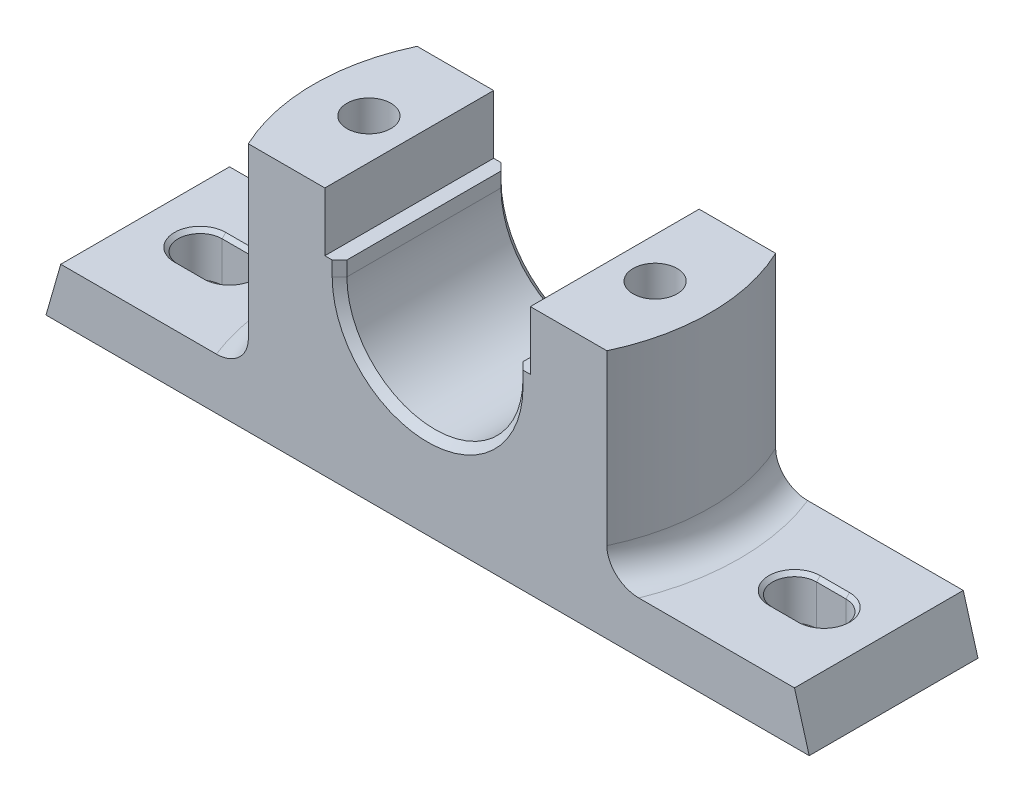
ISO-10303-21;
HEADER;
FILE_DESCRIPTION(('STEP AP214'),'2;1');
FILE_NAME('part.step','',(''),(''),'','','');
FILE_SCHEMA(('AUTOMOTIVE_DESIGN { 1 0 10303 214 1 1 1 1 }'));
ENDSEC;
DATA;
#1=APPLICATION_CONTEXT('core data for automotive mechanical design processes');
#2=APPLICATION_PROTOCOL_DEFINITION('international standard','automotive_design',2000,#1);
#3=PRODUCT_CONTEXT('',#1,'mechanical');
#4=PRODUCT('Part','Part','',(#3));
#5=PRODUCT_RELATED_PRODUCT_CATEGORY('part','',(#4));
#6=PRODUCT_DEFINITION_FORMATION('','',#4);
#7=PRODUCT_DEFINITION_CONTEXT('part definition',#1,'design');
#8=PRODUCT_DEFINITION('design','',#6,#7);
#9=PRODUCT_DEFINITION_SHAPE('','',#8);
#10=(LENGTH_UNIT() NAMED_UNIT(*) SI_UNIT(.MILLI.,.METRE.));
#11=(NAMED_UNIT(*) PLANE_ANGLE_UNIT() SI_UNIT($,.RADIAN.));
#12=(NAMED_UNIT(*) SI_UNIT($,.STERADIAN.) SOLID_ANGLE_UNIT());
#13=UNCERTAINTY_MEASURE_WITH_UNIT(LENGTH_MEASURE(1.E-05),#10,'distance_accuracy_value','');
#14=(GEOMETRIC_REPRESENTATION_CONTEXT(3) GLOBAL_UNCERTAINTY_ASSIGNED_CONTEXT((#13)) GLOBAL_UNIT_ASSIGNED_CONTEXT((#10,
#11,#12)) REPRESENTATION_CONTEXT('',''));
#15=CARTESIAN_POINT('',(0.,0.,0.));
#16=DIRECTION('',(0.,0.,1.));
#17=DIRECTION('',(1.,0.,0.));
#18=AXIS2_PLACEMENT_3D('',#15,#16,#17);
#19=CARTESIAN_POINT('',(54.,68.0000000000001,23.));
#20=DIRECTION('',(0.,-1.,0.));
#21=DIRECTION('',(1.,0.,0.));
#22=AXIS2_PLACEMENT_3D('',#19,#20,#21);
#23=PLANE('',#22);
#24=CARTESIAN_POINT('',(38.9999999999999,68.0000000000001,0.));
#25=DIRECTION('',(0.,1.,0.));
#26=DIRECTION('',(-1.,0.,0.));
#27=AXIS2_PLACEMENT_3D('',#24,#25,#26);
#28=CIRCLE('',#27,5.99999999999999);
#29=CARTESIAN_POINT('',(32.9999999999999,68.0000000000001,0.));
#30=VERTEX_POINT('',#29);
#31=EDGE_CURVE('E388',#30,#30,#28,.T.);
#32=ORIENTED_EDGE('',*,*,#31,.F.);
#33=EDGE_LOOP('',(#32));
#34=FACE_BOUND('',#33,.T.);
#35=CARTESIAN_POINT('',(0.,68.,0.));
#36=DIRECTION('',(0.,1.,0.));
#37=DIRECTION('',(-1.,0.,0.));
#38=AXIS2_PLACEMENT_3D('',#35,#36,#37);
#39=CIRCLE('',#38,53.9999999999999);
#40=CARTESIAN_POINT('',(48.8569340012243,68.0000000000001,23.));
#41=VERTEX_POINT('',#40);
#42=CARTESIAN_POINT('',(48.8569340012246,68.0000000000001,-23.));
#43=VERTEX_POINT('',#42);
#44=EDGE_CURVE('E498',#41,#43,#39,.T.);
#45=ORIENTED_EDGE('',*,*,#44,.T.);
#46=DIRECTION('',(-1.,0.,0.));
#47=VECTOR('',#46,1.);
#48=CARTESIAN_POINT('',(54.,68.0000000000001,-23.));
#49=LINE('',#48,#47);
#50=CARTESIAN_POINT('',(28.,68.0000000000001,-23.));
#51=VERTEX_POINT('',#50);
#52=EDGE_CURVE('E544',#43,#51,#49,.T.);
#53=ORIENTED_EDGE('',*,*,#52,.T.);
#54=DIRECTION('',(0.,0.,-1.));
#55=VECTOR('',#54,1.);
#56=CARTESIAN_POINT('',(28.,68.0000000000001,23.));
#57=LINE('',#56,#55);
#58=CARTESIAN_POINT('',(28.,68.0000000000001,23.));
#59=VERTEX_POINT('',#58);
#60=EDGE_CURVE('E582',#59,#51,#57,.T.);
#61=ORIENTED_EDGE('',*,*,#60,.F.);
#62=DIRECTION('',(-1.,0.,0.));
#63=VECTOR('',#62,1.);
#64=CARTESIAN_POINT('',(54.,68.0000000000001,23.));
#65=LINE('',#64,#63);
#66=EDGE_CURVE('E518',#41,#59,#65,.T.);
#67=ORIENTED_EDGE('',*,*,#66,.F.);
#68=EDGE_LOOP('',(#45,#53,#61,#67));
#69=FACE_BOUND('',#68,.T.);
#70=ADVANCED_FACE('F33',(#34,#69),#23,.F.);
#71=CARTESIAN_POINT('',(-54.,68.0000000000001,23.));
#72=DIRECTION('',(0.,-1.,0.));
#73=DIRECTION('',(1.,0.,0.));
#74=AXIS2_PLACEMENT_3D('',#71,#72,#73);
#75=PLANE('',#74);
#76=CARTESIAN_POINT('',(-38.9999999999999,68.0000000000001,0.));
#77=DIRECTION('',(0.,1.,0.));
#78=DIRECTION('',(-1.,0.,0.));
#79=AXIS2_PLACEMENT_3D('',#76,#77,#78);
#80=CIRCLE('',#79,5.99999999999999);
#81=CARTESIAN_POINT('',(-44.9999999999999,68.0000000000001,0.));
#82=VERTEX_POINT('',#81);
#83=EDGE_CURVE('E392',#82,#82,#80,.T.);
#84=ORIENTED_EDGE('',*,*,#83,.F.);
#85=EDGE_LOOP('',(#84));
#86=FACE_BOUND('',#85,.T.);
#87=CARTESIAN_POINT('',(0.,68.,0.));
#88=DIRECTION('',(0.,1.,0.));
#89=DIRECTION('',(-1.,0.,0.));
#90=AXIS2_PLACEMENT_3D('',#87,#88,#89);
#91=CIRCLE('',#90,53.9999999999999);
#92=CARTESIAN_POINT('',(-48.8569340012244,68.,-23.));
#93=VERTEX_POINT('',#92);
#94=CARTESIAN_POINT('',(-48.8569340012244,68.,23.));
#95=VERTEX_POINT('',#94);
#96=EDGE_CURVE('E493',#93,#95,#91,.T.);
#97=ORIENTED_EDGE('',*,*,#96,.T.);
#98=DIRECTION('',(-1.,0.,0.));
#99=VECTOR('',#98,1.);
#100=CARTESIAN_POINT('',(-54.,68.0000000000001,23.));
#101=LINE('',#100,#99);
#102=CARTESIAN_POINT('',(-28.,68.,23.));
#103=VERTEX_POINT('',#102);
#104=EDGE_CURVE('E529',#103,#95,#101,.T.);
#105=ORIENTED_EDGE('',*,*,#104,.F.);
#106=DIRECTION('',(0.,0.,-1.));
#107=VECTOR('',#106,1.);
#108=CARTESIAN_POINT('',(-28.,68.,23.));
#109=LINE('',#108,#107);
#110=CARTESIAN_POINT('',(-28.,68.,-23.));
#111=VERTEX_POINT('',#110);
#112=EDGE_CURVE('E561',#103,#111,#109,.T.);
#113=ORIENTED_EDGE('',*,*,#112,.T.);
#114=DIRECTION('',(-1.,0.,0.));
#115=VECTOR('',#114,1.);
#116=CARTESIAN_POINT('',(-54.,68.0000000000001,-23.));
#117=LINE('',#116,#115);
#118=EDGE_CURVE('E555',#111,#93,#117,.T.);
#119=ORIENTED_EDGE('',*,*,#118,.T.);
#120=EDGE_LOOP('',(#97,#105,#113,#119));
#121=FACE_BOUND('',#120,.T.);
#122=ADVANCED_FACE('F709',(#86,#121),#75,.F.);
#123=CARTESIAN_POINT('',(-104.,0.,23.));
#124=DIRECTION('',(0.961261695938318,-0.275637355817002,0.));
#125=DIRECTION('',(0.275637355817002,0.961261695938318,0.));
#126=AXIS2_PLACEMENT_3D('',#123,#124,#125);
#127=PLANE('',#126);
#128=DIRECTION('',(-0.275637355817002,-0.961261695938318,0.));
#129=VECTOR('',#128,1.);
#130=CARTESIAN_POINT('',(-104.,0.,-23.));
#131=LINE('',#130,#129);
#132=CARTESIAN_POINT('',(-99.9855645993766,14.,-23.));
#133=VERTEX_POINT('',#132);
#134=CARTESIAN_POINT('',(-104.,0.,-23.));
#135=VERTEX_POINT('',#134);
#136=EDGE_CURVE('E506',#133,#135,#131,.T.);
#137=ORIENTED_EDGE('',*,*,#136,.T.);
#138=DIRECTION('',(0.,0.,-1.));
#139=VECTOR('',#138,1.);
#140=CARTESIAN_POINT('',(-104.,0.,23.));
#141=LINE('',#140,#139);
#142=CARTESIAN_POINT('',(-104.,0.,23.));
#143=VERTEX_POINT('',#142);
#144=EDGE_CURVE('E591',#143,#135,#141,.T.);
#145=ORIENTED_EDGE('',*,*,#144,.F.);
#146=DIRECTION('',(-0.275637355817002,-0.961261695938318,0.));
#147=VECTOR('',#146,1.);
#148=CARTESIAN_POINT('',(-104.,0.,23.));
#149=LINE('',#148,#147);
#150=CARTESIAN_POINT('',(-99.9855645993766,14.,23.));
#151=VERTEX_POINT('',#150);
#152=EDGE_CURVE('E507',#151,#143,#149,.T.);
#153=ORIENTED_EDGE('',*,*,#152,.F.);
#154=DIRECTION('',(0.,0.,-1.));
#155=VECTOR('',#154,1.);
#156=CARTESIAN_POINT('',(-99.9855645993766,14.,23.));
#157=LINE('',#156,#155);
#158=EDGE_CURVE('E534',#151,#133,#157,.T.);
#159=ORIENTED_EDGE('',*,*,#158,.T.);
#160=EDGE_LOOP('',(#137,#145,#153,#159));
#161=FACE_BOUND('',#160,.T.);
#162=ADVANCED_FACE('F715',(#161),#127,.F.);
#163=CARTESIAN_POINT('',(-104.,0.,23.));
#164=DIRECTION('',(0.,1.,0.));
#165=DIRECTION('',(-1.,0.,0.));
#166=AXIS2_PLACEMENT_3D('',#163,#164,#165);
#167=PLANE('',#166);
#168=DIRECTION('',(-1.,0.,0.));
#169=VECTOR('',#168,1.);
#170=CARTESIAN_POINT('',(-97.5,0.,17.5));
#171=LINE('',#170,#169);
#172=CARTESIAN_POINT('',(97.5,0.,17.5));
#173=VERTEX_POINT('',#172);
#174=CARTESIAN_POINT('',(-97.5,0.,17.5));
#175=VERTEX_POINT('',#174);
#176=EDGE_CURVE('E476',#173,#175,#171,.T.);
#177=ORIENTED_EDGE('',*,*,#176,.F.);
#178=DIRECTION('',(0.,0.,1.));
#179=VECTOR('',#178,1.);
#180=CARTESIAN_POINT('',(97.5,0.,-17.5));
#181=LINE('',#180,#179);
#182=CARTESIAN_POINT('',(97.5,0.,-17.5));
#183=VERTEX_POINT('',#182);
#184=EDGE_CURVE('E454',#183,#173,#181,.T.);
#185=ORIENTED_EDGE('',*,*,#184,.F.);
#186=DIRECTION('',(1.,0.,0.));
#187=VECTOR('',#186,1.);
#188=CARTESIAN_POINT('',(-97.5,0.,-17.5));
#189=LINE('',#188,#187);
#190=CARTESIAN_POINT('',(-97.5,0.,-17.5));
#191=VERTEX_POINT('',#190);
#192=EDGE_CURVE('E465',#191,#183,#189,.T.);
#193=ORIENTED_EDGE('',*,*,#192,.F.);
#194=DIRECTION('',(0.,0.,-1.));
#195=VECTOR('',#194,1.);
#196=CARTESIAN_POINT('',(-97.5,0.,-17.5));
#197=LINE('',#196,#195);
#198=EDGE_CURVE('E479',#175,#191,#197,.T.);
#199=ORIENTED_EDGE('',*,*,#198,.F.);
#200=EDGE_LOOP('',(#177,#185,#193,#199));
#201=FACE_BOUND('',#200,.T.);
#202=DIRECTION('',(1.,0.,0.));
#203=VECTOR('',#202,1.);
#204=CARTESIAN_POINT('',(-104.,0.,-23.));
#205=LINE('',#204,#203);
#206=CARTESIAN_POINT('',(104.,0.,-23.));
#207=VERTEX_POINT('',#206);
#208=EDGE_CURVE('E537',#135,#207,#205,.T.);
#209=ORIENTED_EDGE('',*,*,#208,.T.);
#210=DIRECTION('',(0.,0.,-1.));
#211=VECTOR('',#210,1.);
#212=CARTESIAN_POINT('',(104.,0.,23.));
#213=LINE('',#212,#211);
#214=CARTESIAN_POINT('',(104.,0.,23.));
#215=VERTEX_POINT('',#214);
#216=EDGE_CURVE('E588',#215,#207,#213,.T.);
#217=ORIENTED_EDGE('',*,*,#216,.F.);
#218=DIRECTION('',(1.,0.,0.));
#219=VECTOR('',#218,1.);
#220=CARTESIAN_POINT('',(-104.,0.,23.));
#221=LINE('',#220,#219);
#222=EDGE_CURVE('E510',#143,#215,#221,.T.);
#223=ORIENTED_EDGE('',*,*,#222,.F.);
#224=ORIENTED_EDGE('',*,*,#144,.T.);
#225=EDGE_LOOP('',(#209,#217,#223,#224));
#226=FACE_BOUND('',#225,.T.);
#227=ADVANCED_FACE('F731',(#201,#226),#167,.F.);
#228=CARTESIAN_POINT('',(104.,0.,23.));
#229=DIRECTION('',(-0.961261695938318,-0.275637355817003,0.));
#230=DIRECTION('',(0.275637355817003,-0.961261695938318,0.));
#231=AXIS2_PLACEMENT_3D('',#228,#229,#230);
#232=PLANE('',#231);
#233=DIRECTION('',(-0.275637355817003,0.961261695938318,0.));
#234=VECTOR('',#233,1.);
#235=CARTESIAN_POINT('',(104.,0.,-23.));
#236=LINE('',#235,#234);
#237=CARTESIAN_POINT('',(99.9855645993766,14.,-23.));
#238=VERTEX_POINT('',#237);
#239=EDGE_CURVE('E539',#207,#238,#236,.T.);
#240=ORIENTED_EDGE('',*,*,#239,.T.);
#241=DIRECTION('',(0.,0.,-1.));
#242=VECTOR('',#241,1.);
#243=CARTESIAN_POINT('',(99.9855645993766,14.,23.));
#244=LINE('',#243,#242);
#245=CARTESIAN_POINT('',(99.9855645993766,14.,23.));
#246=VERTEX_POINT('',#245);
#247=EDGE_CURVE('E585',#246,#238,#244,.T.);
#248=ORIENTED_EDGE('',*,*,#247,.F.);
#249=DIRECTION('',(-0.275637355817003,0.961261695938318,0.));
#250=VECTOR('',#249,1.);
#251=CARTESIAN_POINT('',(104.,0.,23.));
#252=LINE('',#251,#250);
#253=EDGE_CURVE('E513',#215,#246,#252,.T.);
#254=ORIENTED_EDGE('',*,*,#253,.F.);
#255=ORIENTED_EDGE('',*,*,#216,.T.);
#256=EDGE_LOOP('',(#240,#248,#254,#255));
#257=FACE_BOUND('',#256,.T.);
#258=ADVANCED_FACE('F727',(#257),#232,.F.);
#259=CARTESIAN_POINT('',(99.9855645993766,14.,23.));
#260=DIRECTION('',(0.,-1.,0.));
#261=DIRECTION('',(1.,0.,0.));
#262=AXIS2_PLACEMENT_3D('',#259,#260,#261);
#263=PLANE('',#262);
#264=DIRECTION('',(1.,0.,0.));
#265=VECTOR('',#264,1.);
#266=CARTESIAN_POINT('',(99.9855645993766,14.,-7.));
#267=LINE('',#266,#265);
#268=CARTESIAN_POINT('',(77.,14.,-7.));
#269=VERTEX_POINT('',#268);
#270=CARTESIAN_POINT('',(85.,14.,-7.));
#271=VERTEX_POINT('',#270);
#272=EDGE_CURVE('E870',#269,#271,#267,.T.);
#273=ORIENTED_EDGE('',*,*,#272,.T.);
#274=CARTESIAN_POINT('',(85.,14.,0.));
#275=DIRECTION('',(0.,-1.,0.));
#276=DIRECTION('',(1.,0.,0.));
#277=AXIS2_PLACEMENT_3D('',#274,#275,#276);
#278=CIRCLE('',#277,7.);
#279=CARTESIAN_POINT('',(85.,14.,7.));
#280=VERTEX_POINT('',#279);
#281=EDGE_CURVE('E867',#271,#280,#278,.T.);
#282=ORIENTED_EDGE('',*,*,#281,.T.);
#283=DIRECTION('',(-1.,0.,0.));
#284=VECTOR('',#283,1.);
#285=CARTESIAN_POINT('',(99.9855645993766,14.,7.));
#286=LINE('',#285,#284);
#287=CARTESIAN_POINT('',(77.,14.,7.));
#288=VERTEX_POINT('',#287);
#289=EDGE_CURVE('E872',#280,#288,#286,.T.);
#290=ORIENTED_EDGE('',*,*,#289,.T.);
#291=CARTESIAN_POINT('',(77.,14.,0.));
#292=DIRECTION('',(0.,-1.,0.));
#293=DIRECTION('',(1.,0.,0.));
#294=AXIS2_PLACEMENT_3D('',#291,#292,#293);
#295=CIRCLE('',#294,7.);
#296=EDGE_CURVE('E874',#288,#269,#295,.T.);
#297=ORIENTED_EDGE('',*,*,#296,.T.);
#298=EDGE_LOOP('',(#273,#282,#290,#297));
#299=FACE_BOUND('',#298,.T.);
#300=DIRECTION('',(-1.,0.,0.));
#301=VECTOR('',#300,1.);
#302=CARTESIAN_POINT('',(99.9855645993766,14.,-23.));
#303=LINE('',#302,#301);
#304=CARTESIAN_POINT('',(57.576036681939,14.,-23.));
#305=VERTEX_POINT('',#304);
#306=EDGE_CURVE('E541',#238,#305,#303,.T.);
#307=ORIENTED_EDGE('',*,*,#306,.T.);
#308=CARTESIAN_POINT('',(0.,14.,0.));
#309=DIRECTION('',(0.,-1.,0.));
#310=DIRECTION('',(1.,0.,0.));
#311=AXIS2_PLACEMENT_3D('',#308,#309,#310);
#312=CIRCLE('',#311,61.9999999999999);
#313=CARTESIAN_POINT('',(57.576036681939,14.,23.));
#314=VERTEX_POINT('',#313);
#315=EDGE_CURVE('E606',#305,#314,#312,.T.);
#316=ORIENTED_EDGE('',*,*,#315,.T.);
#317=DIRECTION('',(-1.,0.,0.));
#318=VECTOR('',#317,1.);
#319=CARTESIAN_POINT('',(99.9855645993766,14.,23.));
#320=LINE('',#319,#318);
#321=EDGE_CURVE('E515',#246,#314,#320,.T.);
#322=ORIENTED_EDGE('',*,*,#321,.F.);
#323=ORIENTED_EDGE('',*,*,#247,.T.);
#324=EDGE_LOOP('',(#307,#316,#322,#323));
#325=FACE_BOUND('',#324,.T.);
#326=ADVANCED_FACE('F724',(#299,#325),#263,.F.);
#327=CARTESIAN_POINT('',(28.,68.0000000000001,23.));
#328=DIRECTION('',(1.,0.,0.));
#329=DIRECTION('',(0.,0.,-1.));
#330=AXIS2_PLACEMENT_3D('',#327,#328,#329);
#331=PLANE('',#330);
#332=DIRECTION('',(0.,-1.,0.));
#333=VECTOR('',#332,1.);
#334=CARTESIAN_POINT('',(28.,68.0000000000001,-23.));
#335=LINE('',#334,#333);
#336=CARTESIAN_POINT('',(28.,52.,-23.));
#337=VERTEX_POINT('',#336);
#338=EDGE_CURVE('E546',#51,#337,#335,.T.);
#339=ORIENTED_EDGE('',*,*,#338,.T.);
#340=DIRECTION('',(0.,0.,-1.));
#341=VECTOR('',#340,1.);
#342=CARTESIAN_POINT('',(28.,52.,23.));
#343=LINE('',#342,#341);
#344=CARTESIAN_POINT('',(28.,52.,23.));
#345=VERTEX_POINT('',#344);
#346=EDGE_CURVE('E579',#345,#337,#343,.T.);
#347=ORIENTED_EDGE('',*,*,#346,.F.);
#348=DIRECTION('',(0.,-1.,0.));
#349=VECTOR('',#348,1.);
#350=CARTESIAN_POINT('',(28.,68.0000000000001,23.));
#351=LINE('',#350,#349);
#352=EDGE_CURVE('E520',#59,#345,#351,.T.);
#353=ORIENTED_EDGE('',*,*,#352,.F.);
#354=ORIENTED_EDGE('',*,*,#60,.T.);
#355=EDGE_LOOP('',(#339,#347,#353,#354));
#356=FACE_BOUND('',#355,.T.);
#357=ADVANCED_FACE('F722',(#356),#331,.F.);
#358=CARTESIAN_POINT('',(28.,52.,23.));
#359=DIRECTION('',(0.,-1.,0.));
#360=DIRECTION('',(1.,0.,0.));
#361=AXIS2_PLACEMENT_3D('',#358,#359,#360);
#362=PLANE('',#361);
#363=DIRECTION('',(-1.,0.,0.));
#364=VECTOR('',#363,1.);
#365=CARTESIAN_POINT('',(28.,52.,-23.));
#366=LINE('',#365,#364);
#367=CARTESIAN_POINT('',(26.,52.0000000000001,-23.));
#368=VERTEX_POINT('',#367);
#369=EDGE_CURVE('E548',#337,#368,#366,.T.);
#370=ORIENTED_EDGE('',*,*,#369,.T.);
#371=DIRECTION('',(0.707106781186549,0.,-0.707106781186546));
#372=VECTOR('',#371,1.);
#373=CARTESIAN_POINT('',(24.,52.0000000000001,-21.));
#374=LINE('',#373,#372);
#375=CARTESIAN_POINT('',(24.,52.0000000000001,-21.));
#376=VERTEX_POINT('',#375);
#377=EDGE_CURVE('E782',#368,#376,#374,.F.);
#378=ORIENTED_EDGE('',*,*,#377,.T.);
#379=DIRECTION('',(0.,0.,-1.));
#380=VECTOR('',#379,1.);
#381=CARTESIAN_POINT('',(24.,52.0000000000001,23.));
#382=LINE('',#381,#380);
#383=CARTESIAN_POINT('',(24.,52.0000000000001,21.));
#384=VERTEX_POINT('',#383);
#385=EDGE_CURVE('E576',#384,#376,#382,.T.);
#386=ORIENTED_EDGE('',*,*,#385,.F.);
#387=DIRECTION('',(0.707106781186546,0.,0.707106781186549));
#388=VECTOR('',#387,1.);
#389=CARTESIAN_POINT('',(26.,52.0000000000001,23.));
#390=LINE('',#389,#388);
#391=CARTESIAN_POINT('',(26.,52.0000000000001,23.));
#392=VERTEX_POINT('',#391);
#393=EDGE_CURVE('E781',#384,#392,#390,.T.);
#394=ORIENTED_EDGE('',*,*,#393,.T.);
#395=DIRECTION('',(-1.,0.,0.));
#396=VECTOR('',#395,1.);
#397=CARTESIAN_POINT('',(28.,52.,23.));
#398=LINE('',#397,#396);
#399=EDGE_CURVE('E522',#345,#392,#398,.T.);
#400=ORIENTED_EDGE('',*,*,#399,.F.);
#401=ORIENTED_EDGE('',*,*,#346,.T.);
#402=EDGE_LOOP('',(#370,#378,#386,#394,#400,#401));
#403=FACE_BOUND('',#402,.T.);
#404=ADVANCED_FACE('F778',(#403),#362,.F.);
#405=CARTESIAN_POINT('',(24.,52.0000000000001,23.));
#406=DIRECTION('',(1.,0.,0.));
#407=DIRECTION('',(0.,1.,0.));
#408=AXIS2_PLACEMENT_3D('',#405,#406,#407);
#409=PLANE('',#408);
#410=ORIENTED_EDGE('',*,*,#385,.T.);
#411=DIRECTION('',(0.,-1.,0.));
#412=VECTOR('',#411,1.);
#413=CARTESIAN_POINT('',(24.,52.0000000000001,-21.));
#414=LINE('',#413,#412);
#415=CARTESIAN_POINT('',(24.,48.0000000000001,-21.));
#416=VERTEX_POINT('',#415);
#417=EDGE_CURVE('E836',#376,#416,#414,.T.);
#418=ORIENTED_EDGE('',*,*,#417,.T.);
#419=DIRECTION('',(0.,0.,-1.));
#420=VECTOR('',#419,1.);
#421=CARTESIAN_POINT('',(24.,48.0000000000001,23.));
#422=LINE('',#421,#420);
#423=CARTESIAN_POINT('',(24.,48.0000000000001,21.));
#424=VERTEX_POINT('',#423);
#425=EDGE_CURVE('E573',#424,#416,#422,.T.);
#426=ORIENTED_EDGE('',*,*,#425,.F.);
#427=DIRECTION('',(0.,1.,0.));
#428=VECTOR('',#427,1.);
#429=CARTESIAN_POINT('',(24.,52.0000000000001,21.));
#430=LINE('',#429,#428);
#431=EDGE_CURVE('E841',#424,#384,#430,.T.);
#432=ORIENTED_EDGE('',*,*,#431,.T.);
#433=EDGE_LOOP('',(#410,#418,#426,#432));
#434=FACE_BOUND('',#433,.T.);
#435=ADVANCED_FACE('F1043',(#434),#409,.F.);
#436=CARTESIAN_POINT('',(0.,48.0000000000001,23.));
#437=DIRECTION('',(0.,0.,-1.));
#438=DIRECTION('',(-1.,0.,0.));
#439=AXIS2_PLACEMENT_3D('',#436,#437,#438);
#440=CYLINDRICAL_SURFACE('',#439,24.);
#441=ORIENTED_EDGE('',*,*,#425,.T.);
#442=CARTESIAN_POINT('',(0.,48.0000000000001,-21.));
#443=DIRECTION('',(0.,0.,1.));
#444=DIRECTION('',(1.,0.,0.));
#445=AXIS2_PLACEMENT_3D('',#442,#443,#444);
#446=CIRCLE('',#445,24.);
#447=CARTESIAN_POINT('',(-24.,48.0000000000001,-21.));
#448=VERTEX_POINT('',#447);
#449=EDGE_CURVE('E800',#416,#448,#446,.F.);
#450=ORIENTED_EDGE('',*,*,#449,.T.);
#451=DIRECTION('',(0.,0.,-1.));
#452=VECTOR('',#451,1.);
#453=CARTESIAN_POINT('',(-24.,48.0000000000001,23.));
#454=LINE('',#453,#452);
#455=CARTESIAN_POINT('',(-24.,48.0000000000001,21.));
#456=VERTEX_POINT('',#455);
#457=EDGE_CURVE('E570',#456,#448,#454,.T.);
#458=ORIENTED_EDGE('',*,*,#457,.F.);
#459=CARTESIAN_POINT('',(0.,48.0000000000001,21.));
#460=DIRECTION('',(0.,0.,1.));
#461=DIRECTION('',(1.,0.,0.));
#462=AXIS2_PLACEMENT_3D('',#459,#460,#461);
#463=CIRCLE('',#462,24.);
#464=EDGE_CURVE('E798',#456,#424,#463,.T.);
#465=ORIENTED_EDGE('',*,*,#464,.T.);
#466=EDGE_LOOP('',(#441,#450,#458,#465));
#467=FACE_BOUND('',#466,.T.);
#468=ADVANCED_FACE('F1035',(#467),#440,.F.);
#469=CARTESIAN_POINT('',(-24.,52.0000000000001,23.));
#470=DIRECTION('',(-1.,0.,0.));
#471=DIRECTION('',(0.,0.,1.));
#472=AXIS2_PLACEMENT_3D('',#469,#470,#471);
#473=PLANE('',#472);
#474=ORIENTED_EDGE('',*,*,#457,.T.);
#475=DIRECTION('',(0.,1.,0.));
#476=VECTOR('',#475,1.);
#477=CARTESIAN_POINT('',(-24.,52.0000000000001,-21.));
#478=LINE('',#477,#476);
#479=CARTESIAN_POINT('',(-24.,52.0000000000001,-21.));
#480=VERTEX_POINT('',#479);
#481=EDGE_CURVE('E792',#448,#480,#478,.T.);
#482=ORIENTED_EDGE('',*,*,#481,.T.);
#483=DIRECTION('',(0.,0.,-1.));
#484=VECTOR('',#483,1.);
#485=CARTESIAN_POINT('',(-24.,52.0000000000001,23.));
#486=LINE('',#485,#484);
#487=CARTESIAN_POINT('',(-24.,52.0000000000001,21.));
#488=VERTEX_POINT('',#487);
#489=EDGE_CURVE('E567',#488,#480,#486,.T.);
#490=ORIENTED_EDGE('',*,*,#489,.F.);
#491=DIRECTION('',(0.,-1.,0.));
#492=VECTOR('',#491,1.);
#493=CARTESIAN_POINT('',(-24.,48.0000000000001,21.));
#494=LINE('',#493,#492);
#495=EDGE_CURVE('E785',#488,#456,#494,.T.);
#496=ORIENTED_EDGE('',*,*,#495,.T.);
#497=EDGE_LOOP('',(#474,#482,#490,#496));
#498=FACE_BOUND('',#497,.T.);
#499=ADVANCED_FACE('F1028',(#498),#473,.F.);
#500=CARTESIAN_POINT('',(-28.,52.,23.));
#501=DIRECTION('',(0.,-1.,0.));
#502=DIRECTION('',(1.,0.,0.));
#503=AXIS2_PLACEMENT_3D('',#500,#501,#502);
#504=PLANE('',#503);
#505=ORIENTED_EDGE('',*,*,#489,.T.);
#506=DIRECTION('',(0.707106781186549,0.,0.707106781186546));
#507=VECTOR('',#506,1.);
#508=CARTESIAN_POINT('',(-24.,52.0000000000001,-21.));
#509=LINE('',#508,#507);
#510=CARTESIAN_POINT('',(-26.,52.0000000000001,-23.));
#511=VERTEX_POINT('',#510);
#512=EDGE_CURVE('E796',#480,#511,#509,.F.);
#513=ORIENTED_EDGE('',*,*,#512,.T.);
#514=DIRECTION('',(-1.,0.,0.));
#515=VECTOR('',#514,1.);
#516=CARTESIAN_POINT('',(-28.,52.,-23.));
#517=LINE('',#516,#515);
#518=CARTESIAN_POINT('',(-28.,52.,-23.));
#519=VERTEX_POINT('',#518);
#520=EDGE_CURVE('E551',#511,#519,#517,.T.);
#521=ORIENTED_EDGE('',*,*,#520,.T.);
#522=DIRECTION('',(0.,0.,-1.));
#523=VECTOR('',#522,1.);
#524=CARTESIAN_POINT('',(-28.,52.,23.));
#525=LINE('',#524,#523);
#526=CARTESIAN_POINT('',(-28.,52.,23.));
#527=VERTEX_POINT('',#526);
#528=EDGE_CURVE('E564',#527,#519,#525,.T.);
#529=ORIENTED_EDGE('',*,*,#528,.F.);
#530=DIRECTION('',(-1.,0.,0.));
#531=VECTOR('',#530,1.);
#532=CARTESIAN_POINT('',(-28.,52.,23.));
#533=LINE('',#532,#531);
#534=CARTESIAN_POINT('',(-26.,52.0000000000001,23.));
#535=VERTEX_POINT('',#534);
#536=EDGE_CURVE('E525',#535,#527,#533,.T.);
#537=ORIENTED_EDGE('',*,*,#536,.F.);
#538=DIRECTION('',(0.707106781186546,0.,-0.707106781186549));
#539=VECTOR('',#538,1.);
#540=CARTESIAN_POINT('',(-26.,52.0000000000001,23.));
#541=LINE('',#540,#539);
#542=EDGE_CURVE('E794',#535,#488,#541,.T.);
#543=ORIENTED_EDGE('',*,*,#542,.T.);
#544=EDGE_LOOP('',(#505,#513,#521,#529,#537,#543));
#545=FACE_BOUND('',#544,.T.);
#546=ADVANCED_FACE('F816',(#545),#504,.F.);
#547=CARTESIAN_POINT('',(-28.,68.,23.));
#548=DIRECTION('',(-1.,0.,0.));
#549=DIRECTION('',(0.,0.,1.));
#550=AXIS2_PLACEMENT_3D('',#547,#548,#549);
#551=PLANE('',#550);
#552=DIRECTION('',(0.,1.,0.));
#553=VECTOR('',#552,1.);
#554=CARTESIAN_POINT('',(-28.,68.,-23.));
#555=LINE('',#554,#553);
#556=EDGE_CURVE('E553',#519,#111,#555,.T.);
#557=ORIENTED_EDGE('',*,*,#556,.T.);
#558=ORIENTED_EDGE('',*,*,#112,.F.);
#559=DIRECTION('',(0.,1.,0.));
#560=VECTOR('',#559,1.);
#561=CARTESIAN_POINT('',(-28.,68.,23.));
#562=LINE('',#561,#560);
#563=EDGE_CURVE('E527',#527,#103,#562,.T.);
#564=ORIENTED_EDGE('',*,*,#563,.F.);
#565=ORIENTED_EDGE('',*,*,#528,.T.);
#566=EDGE_LOOP('',(#557,#558,#564,#565));
#567=FACE_BOUND('',#566,.T.);
#568=ADVANCED_FACE('F823',(#567),#551,.F.);
#569=CARTESIAN_POINT('',(-99.9855645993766,14.,23.));
#570=DIRECTION('',(0.,-1.,0.));
#571=DIRECTION('',(1.,0.,0.));
#572=AXIS2_PLACEMENT_3D('',#569,#570,#571);
#573=PLANE('',#572);
#574=DIRECTION('',(1.,0.,0.));
#575=VECTOR('',#574,1.);
#576=CARTESIAN_POINT('',(-99.9855645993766,14.,-7.));
#577=LINE('',#576,#575);
#578=CARTESIAN_POINT('',(-85.,14.,-7.));
#579=VERTEX_POINT('',#578);
#580=CARTESIAN_POINT('',(-77.,14.,-7.));
#581=VERTEX_POINT('',#580);
#582=EDGE_CURVE('E888',#579,#581,#577,.T.);
#583=ORIENTED_EDGE('',*,*,#582,.T.);
#584=CARTESIAN_POINT('',(-77.,14.,0.));
#585=DIRECTION('',(0.,-1.,0.));
#586=DIRECTION('',(1.,0.,0.));
#587=AXIS2_PLACEMENT_3D('',#584,#585,#586);
#588=CIRCLE('',#587,7.);
#589=CARTESIAN_POINT('',(-77.,14.,7.));
#590=VERTEX_POINT('',#589);
#591=EDGE_CURVE('E885',#581,#590,#588,.T.);
#592=ORIENTED_EDGE('',*,*,#591,.T.);
#593=DIRECTION('',(-1.,0.,0.));
#594=VECTOR('',#593,1.);
#595=CARTESIAN_POINT('',(-99.9855645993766,14.,7.));
#596=LINE('',#595,#594);
#597=CARTESIAN_POINT('',(-85.,14.,7.));
#598=VERTEX_POINT('',#597);
#599=EDGE_CURVE('E890',#590,#598,#596,.T.);
#600=ORIENTED_EDGE('',*,*,#599,.T.);
#601=CARTESIAN_POINT('',(-85.,14.,0.));
#602=DIRECTION('',(0.,-1.,0.));
#603=DIRECTION('',(1.,0.,0.));
#604=AXIS2_PLACEMENT_3D('',#601,#602,#603);
#605=CIRCLE('',#604,7.);
#606=EDGE_CURVE('E891',#598,#579,#605,.T.);
#607=ORIENTED_EDGE('',*,*,#606,.T.);
#608=EDGE_LOOP('',(#583,#592,#600,#607));
#609=FACE_BOUND('',#608,.T.);
#610=DIRECTION('',(-1.,0.,0.));
#611=VECTOR('',#610,1.);
#612=CARTESIAN_POINT('',(-99.9855645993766,14.,23.));
#613=LINE('',#612,#611);
#614=CARTESIAN_POINT('',(-57.5760366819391,14.,23.));
#615=VERTEX_POINT('',#614);
#616=EDGE_CURVE('E532',#615,#151,#613,.T.);
#617=ORIENTED_EDGE('',*,*,#616,.F.);
#618=CARTESIAN_POINT('',(0.,14.,0.));
#619=DIRECTION('',(0.,-1.,0.));
#620=DIRECTION('',(1.,0.,0.));
#621=AXIS2_PLACEMENT_3D('',#618,#619,#620);
#622=CIRCLE('',#621,61.9999999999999);
#623=CARTESIAN_POINT('',(-57.5760366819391,14.,-23.));
#624=VERTEX_POINT('',#623);
#625=EDGE_CURVE('E601',#615,#624,#622,.T.);
#626=ORIENTED_EDGE('',*,*,#625,.T.);
#627=DIRECTION('',(-1.,0.,0.));
#628=VECTOR('',#627,1.);
#629=CARTESIAN_POINT('',(-99.9855645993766,14.,-23.));
#630=LINE('',#629,#628);
#631=EDGE_CURVE('E511',#624,#133,#630,.T.);
#632=ORIENTED_EDGE('',*,*,#631,.T.);
#633=ORIENTED_EDGE('',*,*,#158,.F.);
#634=EDGE_LOOP('',(#617,#626,#632,#633));
#635=FACE_BOUND('',#634,.T.);
#636=ADVANCED_FACE('F630',(#609,#635),#573,.F.);
#637=CARTESIAN_POINT('',(0.,48.0000000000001,23.));
#638=DIRECTION('',(0.,0.,1.));
#639=DIRECTION('',(1.,0.,0.));
#640=AXIS2_PLACEMENT_3D('',#637,#638,#639);
#641=PLANE('',#640);
#642=ORIENTED_EDGE('',*,*,#399,.T.);
#643=DIRECTION('',(0.,-1.,0.));
#644=VECTOR('',#643,1.);
#645=CARTESIAN_POINT('',(26.,48.0000000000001,23.));
#646=LINE('',#645,#644);
#647=CARTESIAN_POINT('',(26.,48.0000000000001,23.));
#648=VERTEX_POINT('',#647);
#649=EDGE_CURVE('E12',#392,#648,#646,.T.);
#650=ORIENTED_EDGE('',*,*,#649,.T.);
#651=CARTESIAN_POINT('',(0.,48.0000000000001,23.));
#652=DIRECTION('',(0.,0.,1.));
#653=DIRECTION('',(1.,0.,0.));
#654=AXIS2_PLACEMENT_3D('',#651,#652,#653);
#655=CIRCLE('',#654,26.);
#656=CARTESIAN_POINT('',(-26.,48.0000000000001,23.));
#657=VERTEX_POINT('',#656);
#658=EDGE_CURVE('E49',#648,#657,#655,.F.);
#659=ORIENTED_EDGE('',*,*,#658,.T.);
#660=DIRECTION('',(0.,1.,0.));
#661=VECTOR('',#660,1.);
#662=CARTESIAN_POINT('',(-26.,52.0000000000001,23.));
#663=LINE('',#662,#661);
#664=EDGE_CURVE('E42',#657,#535,#663,.T.);
#665=ORIENTED_EDGE('',*,*,#664,.T.);
#666=ORIENTED_EDGE('',*,*,#536,.T.);
#667=ORIENTED_EDGE('',*,*,#563,.T.);
#668=ORIENTED_EDGE('',*,*,#104,.T.);
#669=DIRECTION('',(0.,1.,0.));
#670=VECTOR('',#669,1.);
#671=CARTESIAN_POINT('',(-48.8569340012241,-215.666901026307,23.));
#672=LINE('',#671,#670);
#673=CARTESIAN_POINT('',(-48.8569340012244,22.,23.));
#674=VERTEX_POINT('',#673);
#675=EDGE_CURVE('E501',#674,#95,#672,.T.);
#676=ORIENTED_EDGE('',*,*,#675,.F.);
#677=CARTESIAN_POINT('',(-48.8569340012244,22.,23.));
#678=CARTESIAN_POINT('',(-48.8568944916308,21.7897037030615,23.));
#679=CARTESIAN_POINT('',(-48.8660972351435,21.5794200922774,23.));
#680=CARTESIAN_POINT('',(-48.9026955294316,21.1604976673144,23.));
#681=CARTESIAN_POINT('',(-48.9300861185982,20.9518584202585,23.));
#682=CARTESIAN_POINT('',(-49.0026422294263,20.5384483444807,23.));
#683=CARTESIAN_POINT('',(-49.0477455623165,20.333666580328,23.));
#684=CARTESIAN_POINT('',(-49.1551914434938,19.928676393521,23.));
#685=CARTESIAN_POINT('',(-49.2175345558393,19.7284681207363,23.));
#686=CARTESIAN_POINT('',(-49.3587056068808,19.3341515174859,23.));
#687=CARTESIAN_POINT('',(-49.4375194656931,19.1400381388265,23.));
#688=CARTESIAN_POINT('',(-49.6108643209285,18.7588835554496,23.));
#689=CARTESIAN_POINT('',(-49.7054011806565,18.5718450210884,23.));
#690=CARTESIAN_POINT('',(-49.9092601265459,18.2059678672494,23.));
#691=CARTESIAN_POINT('',(-50.0185851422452,18.0271308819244,23.));
#692=CARTESIAN_POINT('',(-50.251044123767,17.6785870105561,23.));
#693=CARTESIAN_POINT('',(-50.374183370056,17.5088836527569,23.));
#694=CARTESIAN_POINT('',(-50.6386238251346,17.1726098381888,23.));
#695=CARTESIAN_POINT('',(-50.7804689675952,17.0064666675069,23.));
#696=CARTESIAN_POINT('',(-51.0768009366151,16.6858302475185,23.));
#697=CARTESIAN_POINT('',(-51.2312923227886,16.5313412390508,23.));
#698=CARTESIAN_POINT('',(-51.711907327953,16.0864805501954,23.));
#699=CARTESIAN_POINT('',(-52.0553511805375,15.8144890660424,23.));
#700=CARTESIAN_POINT('',(-52.8107494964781,15.3025371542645,23.));
#701=CARTESIAN_POINT('',(-53.2260819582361,15.0675926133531,23.));
#702=CARTESIAN_POINT('',(-54.0883596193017,14.6652815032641,23.));
#703=CARTESIAN_POINT('',(-54.5353157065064,14.497938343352,23.));
#704=CARTESIAN_POINT('',(-55.4119481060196,14.2445948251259,23.));
#705=CARTESIAN_POINT('',(-55.8400171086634,14.153031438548,23.));
#706=CARTESIAN_POINT('',(-56.4880371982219,14.0613163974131,23.));
#707=CARTESIAN_POINT('',(-56.7049685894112,14.0383497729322,23.));
#708=CARTESIAN_POINT('',(-57.1399216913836,14.0076931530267,23.));
#709=CARTESIAN_POINT('',(-57.3579434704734,14.0000041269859,23.));
#710=CARTESIAN_POINT('',(-57.5760366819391,14.,23.));
#711=B_SPLINE_CURVE_WITH_KNOTS('',3,(#677,#678,#679,#680,#681,#682,#683,#684,#685,#686,#687,
#688,#689,#690,#691,#692,#693,#694,#695,#696,#697,#698,#699,#700,#701,#702,#703,#704,#705,#706,
#707,#708,#709,#710),.UNSPECIFIED.,.F.,.F.,(4,2,2,2,2,2,2,2,2,2,2,2,2,2,2,2,4),(0.,
0.630667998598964,1.26116402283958,1.88946591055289,2.51778835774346,3.1455758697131,
3.77359801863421,4.40174476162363,5.03013243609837,5.68478012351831,6.33966489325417,
7.64857785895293,9.07415774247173,10.5002308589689,11.8088856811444,12.462847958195,
13.1168517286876),.UNSPECIFIED.);
#712=EDGE_CURVE('E608',#674,#615,#711,.T.);
#713=ORIENTED_EDGE('',*,*,#712,.T.);
#714=ORIENTED_EDGE('',*,*,#616,.T.);
#715=ORIENTED_EDGE('',*,*,#152,.T.);
#716=ORIENTED_EDGE('',*,*,#222,.T.);
#717=ORIENTED_EDGE('',*,*,#253,.T.);
#718=ORIENTED_EDGE('',*,*,#321,.T.);
#719=CARTESIAN_POINT('',(57.576036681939,14.,23.));
#720=CARTESIAN_POINT('',(57.3157465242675,13.9999861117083,23.));
#721=CARTESIAN_POINT('',(57.0554642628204,14.0109545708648,23.));
#722=CARTESIAN_POINT('',(56.5367274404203,14.0546304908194,23.));
#723=CARTESIAN_POINT('',(56.2782728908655,14.0873380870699,23.));
#724=CARTESIAN_POINT('',(55.7647130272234,14.1743163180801,23.));
#725=CARTESIAN_POINT('',(55.5096118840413,14.228611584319,23.));
#726=CARTESIAN_POINT('',(55.0048736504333,14.3584433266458,23.));
#727=CARTESIAN_POINT('',(54.755236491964,14.4339795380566,23.));
#728=CARTESIAN_POINT('',(54.2630898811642,14.6059576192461,23.));
#729=CARTESIAN_POINT('',(54.0205849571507,14.7024124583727,23.));
#730=CARTESIAN_POINT('',(53.54462901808,14.9157643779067,23.));
#731=CARTESIAN_POINT('',(53.3111812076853,15.0326686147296,23.));
#732=CARTESIAN_POINT('',(52.8554559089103,15.2862486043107,23.));
#733=CARTESIAN_POINT('',(52.6331717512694,15.4229123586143,23.));
#734=CARTESIAN_POINT('',(52.2015693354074,15.7153670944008,23.));
#735=CARTESIAN_POINT('',(51.9922500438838,15.8711565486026,23.));
#736=CARTESIAN_POINT('',(51.5944194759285,16.1962302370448,23.));
#737=CARTESIAN_POINT('',(51.4054800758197,16.3649902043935,23.));
#738=CARTESIAN_POINT('',(51.0436072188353,16.7187493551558,23.));
#739=CARTESIAN_POINT('',(50.8706666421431,16.9037412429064,23.));
#740=CARTESIAN_POINT('',(50.5425384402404,17.2889300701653,23.));
#741=CARTESIAN_POINT('',(50.3873540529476,17.4891297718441,23.));
#742=CARTESIAN_POINT('',(50.0966425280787,17.903321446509,23.));
#743=CARTESIAN_POINT('',(49.9611128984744,18.1173116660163,23.));
#744=CARTESIAN_POINT('',(49.7218092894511,18.5392382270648,23.));
#745=CARTESIAN_POINT('',(49.6163360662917,18.7462117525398,23.));
#746=CARTESIAN_POINT('',(49.4246955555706,19.1689008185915,23.));
#747=CARTESIAN_POINT('',(49.3385256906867,19.384615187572,23.));
#748=CARTESIAN_POINT('',(49.1867319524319,19.822743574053,23.));
#749=CARTESIAN_POINT('',(49.121072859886,20.0451453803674,23.));
#750=CARTESIAN_POINT('',(49.0110307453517,20.4950496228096,23.));
#751=CARTESIAN_POINT('',(48.9666359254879,20.7225491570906,23.));
#752=CARTESIAN_POINT('',(48.9078153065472,21.1252552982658,23.));
#753=CARTESIAN_POINT('',(48.8887373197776,21.2997960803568,23.));
#754=CARTESIAN_POINT('',(48.8632978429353,21.6495508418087,23.));
#755=CARTESIAN_POINT('',(48.8569182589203,21.8247635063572,23.));
#756=CARTESIAN_POINT('',(48.8569340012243,22.,23.));
#757=B_SPLINE_CURVE_WITH_KNOTS('',3,(#719,#720,#721,#722,#723,#724,#725,#726,#727,#728,#729,
#730,#731,#732,#733,#734,#735,#736,#737,#738,#739,#740,#741,#742,#743,#744,#745,#746,#747,#748,
#749,#750,#751,#752,#753,#754,#755,#756),.UNSPECIFIED.,.F.,.F.,(4,2,2,2,2,2,2,2,2,2,2,2,2,2,2,2,
2,2,4),(0.,0.780629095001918,1.56126305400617,2.34279028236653,3.12430777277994,
3.90631118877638,4.68858882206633,5.47039341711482,6.25213562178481,7.01114143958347,
7.76980784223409,8.52861237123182,9.28732060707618,9.98328546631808,10.6791573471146,
11.3738276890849,12.068112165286,12.5944106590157,13.1199586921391),.UNSPECIFIED.);
#758=CARTESIAN_POINT('',(48.8569340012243,22.,23.));
#759=VERTEX_POINT('',#758);
#760=EDGE_CURVE('E637',#314,#759,#757,.T.);
#761=ORIENTED_EDGE('',*,*,#760,.T.);
#762=DIRECTION('',(0.,1.,0.));
#763=VECTOR('',#762,1.);
#764=CARTESIAN_POINT('',(48.8569340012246,-215.666901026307,23.));
#765=LINE('',#764,#763);
#766=EDGE_CURVE('E486',#759,#41,#765,.T.);
#767=ORIENTED_EDGE('',*,*,#766,.T.);
#768=ORIENTED_EDGE('',*,*,#66,.T.);
#769=ORIENTED_EDGE('',*,*,#352,.T.);
#770=EDGE_LOOP('',(#642,#650,#659,#665,#666,#667,#668,#676,#713,#714,#715,#716,#717,#718,#761,
#767,#768,#769));
#771=FACE_BOUND('',#770,.T.);
#772=ADVANCED_FACE('F625',(#771),#641,.T.);
#773=CARTESIAN_POINT('',(0.,48.0000000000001,-23.));
#774=DIRECTION('',(0.,0.,1.));
#775=DIRECTION('',(1.,0.,0.));
#776=AXIS2_PLACEMENT_3D('',#773,#774,#775);
#777=PLANE('',#776);
#778=CARTESIAN_POINT('',(0.,48.0000000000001,-23.));
#779=DIRECTION('',(0.,0.,1.));
#780=DIRECTION('',(1.,0.,0.));
#781=AXIS2_PLACEMENT_3D('',#778,#779,#780);
#782=CIRCLE('',#781,26.);
#783=CARTESIAN_POINT('',(-26.,48.0000000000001,-23.));
#784=VERTEX_POINT('',#783);
#785=CARTESIAN_POINT('',(26.,48.0000000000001,-23.));
#786=VERTEX_POINT('',#785);
#787=EDGE_CURVE('E835',#784,#786,#782,.T.);
#788=ORIENTED_EDGE('',*,*,#787,.T.);
#789=DIRECTION('',(0.,1.,0.));
#790=VECTOR('',#789,1.);
#791=CARTESIAN_POINT('',(26.,47.9999999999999,-23.));
#792=LINE('',#791,#790);
#793=EDGE_CURVE('E783',#786,#368,#792,.T.);
#794=ORIENTED_EDGE('',*,*,#793,.T.);
#795=ORIENTED_EDGE('',*,*,#369,.F.);
#796=ORIENTED_EDGE('',*,*,#338,.F.);
#797=ORIENTED_EDGE('',*,*,#52,.F.);
#798=DIRECTION('',(0.,1.,0.));
#799=VECTOR('',#798,1.);
#800=CARTESIAN_POINT('',(48.8569340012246,-215.666901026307,-23.));
#801=LINE('',#800,#799);
#802=CARTESIAN_POINT('',(48.8569340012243,22.,-23.));
#803=VERTEX_POINT('',#802);
#804=EDGE_CURVE('E496',#803,#43,#801,.T.);
#805=ORIENTED_EDGE('',*,*,#804,.F.);
#806=CARTESIAN_POINT('',(48.8569340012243,22.,-23.));
#807=CARTESIAN_POINT('',(48.8568944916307,21.7897037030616,-23.));
#808=CARTESIAN_POINT('',(48.8660972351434,21.5794200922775,-23.));
#809=CARTESIAN_POINT('',(48.9026955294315,21.1604976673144,-23.));
#810=CARTESIAN_POINT('',(48.9300861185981,20.9518584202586,-23.));
#811=CARTESIAN_POINT('',(49.0026422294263,20.5384483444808,-23.));
#812=CARTESIAN_POINT('',(49.0477455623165,20.333666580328,-23.));
#813=CARTESIAN_POINT('',(49.1551914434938,19.928676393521,-23.));
#814=CARTESIAN_POINT('',(49.2175345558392,19.7284681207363,-23.));
#815=CARTESIAN_POINT('',(49.3587056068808,19.334151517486,-23.));
#816=CARTESIAN_POINT('',(49.4375194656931,19.1400381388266,-23.));
#817=CARTESIAN_POINT('',(49.6108643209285,18.7588835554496,-23.));
#818=CARTESIAN_POINT('',(49.7054011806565,18.5718450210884,-23.));
#819=CARTESIAN_POINT('',(49.9092601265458,18.2059678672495,-23.));
#820=CARTESIAN_POINT('',(50.0185851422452,18.0271308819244,-23.));
#821=CARTESIAN_POINT('',(50.2510441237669,17.6785870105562,-23.));
#822=CARTESIAN_POINT('',(50.374183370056,17.508883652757,-23.));
#823=CARTESIAN_POINT('',(50.6386238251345,17.1726098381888,-23.));
#824=CARTESIAN_POINT('',(50.7804689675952,17.0064666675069,-23.));
#825=CARTESIAN_POINT('',(51.0768009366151,16.6858302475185,-23.));
#826=CARTESIAN_POINT('',(51.2312923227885,16.5313412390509,-23.));
#827=CARTESIAN_POINT('',(51.711907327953,16.0864805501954,-23.));
#828=CARTESIAN_POINT('',(52.0553511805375,15.8144890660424,-23.));
#829=CARTESIAN_POINT('',(52.8107494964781,15.3025371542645,-23.));
#830=CARTESIAN_POINT('',(53.2260819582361,15.0675926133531,-23.));
#831=CARTESIAN_POINT('',(54.0883596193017,14.6652815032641,-23.));
#832=CARTESIAN_POINT('',(54.5353157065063,14.4979383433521,-23.));
#833=CARTESIAN_POINT('',(55.4119481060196,14.2445948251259,-23.));
#834=CARTESIAN_POINT('',(55.8400171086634,14.153031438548,-23.));
#835=CARTESIAN_POINT('',(56.4880371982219,14.0613163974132,-23.));
#836=CARTESIAN_POINT('',(56.7049685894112,14.0383497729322,-23.));
#837=CARTESIAN_POINT('',(57.1399216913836,14.0076931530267,-23.));
#838=CARTESIAN_POINT('',(57.3579434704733,14.0000041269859,-23.));
#839=CARTESIAN_POINT('',(57.576036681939,14.0000000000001,-23.));
#840=B_SPLINE_CURVE_WITH_KNOTS('',3,(#806,#807,#808,#809,#810,#811,#812,#813,#814,#815,#816,
#817,#818,#819,#820,#821,#822,#823,#824,#825,#826,#827,#828,#829,#830,#831,#832,#833,#834,#835,
#836,#837,#838,#839),.UNSPECIFIED.,.F.,.F.,(4,2,2,2,2,2,2,2,2,2,2,2,2,2,2,2,4),(0.,
0.630667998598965,1.26116402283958,1.88946591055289,2.51778835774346,3.14557586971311,
3.77359801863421,4.40174476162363,5.03013243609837,5.68478012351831,6.33966489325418,
7.64857785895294,9.07415774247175,10.5002308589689,11.8088856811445,12.462847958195,
13.1168517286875),.UNSPECIFIED.);
#841=EDGE_CURVE('E643',#803,#305,#840,.T.);
#842=ORIENTED_EDGE('',*,*,#841,.T.);
#843=ORIENTED_EDGE('',*,*,#306,.F.);
#844=ORIENTED_EDGE('',*,*,#239,.F.);
#845=ORIENTED_EDGE('',*,*,#208,.F.);
#846=ORIENTED_EDGE('',*,*,#136,.F.);
#847=ORIENTED_EDGE('',*,*,#631,.F.);
#848=CARTESIAN_POINT('',(-57.5760366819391,14.,-23.));
#849=CARTESIAN_POINT('',(-57.3157465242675,13.9999861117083,-23.));
#850=CARTESIAN_POINT('',(-57.0554642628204,14.0109545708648,-23.));
#851=CARTESIAN_POINT('',(-56.5367274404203,14.0546304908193,-23.));
#852=CARTESIAN_POINT('',(-56.2782728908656,14.0873380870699,-23.));
#853=CARTESIAN_POINT('',(-55.7647130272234,14.17431631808,-23.));
#854=CARTESIAN_POINT('',(-55.5096118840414,14.228611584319,-23.));
#855=CARTESIAN_POINT('',(-55.0048736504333,14.3584433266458,-23.));
#856=CARTESIAN_POINT('',(-54.755236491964,14.4339795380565,-23.));
#857=CARTESIAN_POINT('',(-54.2630898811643,14.6059576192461,-23.));
#858=CARTESIAN_POINT('',(-54.0205849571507,14.7024124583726,-23.));
#859=CARTESIAN_POINT('',(-53.5446290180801,14.9157643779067,-23.));
#860=CARTESIAN_POINT('',(-53.3111812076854,15.0326686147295,-23.));
#861=CARTESIAN_POINT('',(-52.8554559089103,15.2862486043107,-23.));
#862=CARTESIAN_POINT('',(-52.6331717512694,15.4229123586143,-23.));
#863=CARTESIAN_POINT('',(-52.2015693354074,15.7153670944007,-23.));
#864=CARTESIAN_POINT('',(-51.9922500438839,15.8711565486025,-23.));
#865=CARTESIAN_POINT('',(-51.5944194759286,16.1962302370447,-23.));
#866=CARTESIAN_POINT('',(-51.4054800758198,16.3649902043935,-23.));
#867=CARTESIAN_POINT('',(-51.0436072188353,16.7187493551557,-23.));
#868=CARTESIAN_POINT('',(-50.8706666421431,16.9037412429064,-23.));
#869=CARTESIAN_POINT('',(-50.5425384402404,17.2889300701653,-23.));
#870=CARTESIAN_POINT('',(-50.3873540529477,17.4891297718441,-23.));
#871=CARTESIAN_POINT('',(-50.0966425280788,17.903321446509,-23.));
#872=CARTESIAN_POINT('',(-49.9611128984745,18.1173116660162,-23.));
#873=CARTESIAN_POINT('',(-49.7218092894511,18.5392382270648,-23.));
#874=CARTESIAN_POINT('',(-49.6163360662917,18.7462117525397,-23.));
#875=CARTESIAN_POINT('',(-49.4246955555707,19.1689008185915,-23.));
#876=CARTESIAN_POINT('',(-49.3385256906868,19.384615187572,-23.));
#877=CARTESIAN_POINT('',(-49.186731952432,19.822743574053,-23.));
#878=CARTESIAN_POINT('',(-49.121072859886,20.0451453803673,-23.));
#879=CARTESIAN_POINT('',(-49.0110307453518,20.4950496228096,-23.));
#880=CARTESIAN_POINT('',(-48.9666359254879,20.7225491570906,-23.));
#881=CARTESIAN_POINT('',(-48.9078153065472,21.1252552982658,-23.));
#882=CARTESIAN_POINT('',(-48.8887373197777,21.2997960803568,-23.));
#883=CARTESIAN_POINT('',(-48.8632978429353,21.6495508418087,-23.));
#884=CARTESIAN_POINT('',(-48.8569182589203,21.8247635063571,-23.));
#885=CARTESIAN_POINT('',(-48.8569340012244,22.,-23.));
#886=B_SPLINE_CURVE_WITH_KNOTS('',3,(#848,#849,#850,#851,#852,#853,#854,#855,#856,#857,#858,
#859,#860,#861,#862,#863,#864,#865,#866,#867,#868,#869,#870,#871,#872,#873,#874,#875,#876,#877,
#878,#879,#880,#881,#882,#883,#884,#885),.UNSPECIFIED.,.F.,.F.,(4,2,2,2,2,2,2,2,2,2,2,2,2,2,2,2,
2,2,4),(0.,0.780629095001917,1.56126305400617,2.34279028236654,3.12430777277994,
3.90631118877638,4.68858882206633,5.47039341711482,6.2521356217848,7.01114143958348,
7.7698078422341,8.52861237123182,9.28732060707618,9.98328546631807,10.6791573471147,
11.3738276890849,12.068112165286,12.5944106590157,13.1199586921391),.UNSPECIFIED.);
#887=CARTESIAN_POINT('',(-48.8569340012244,22.,-23.));
#888=VERTEX_POINT('',#887);
#889=EDGE_CURVE('E615',#624,#888,#886,.T.);
#890=ORIENTED_EDGE('',*,*,#889,.T.);
#891=DIRECTION('',(0.,1.,0.));
#892=VECTOR('',#891,1.);
#893=CARTESIAN_POINT('',(-48.8569340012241,-215.666901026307,-23.));
#894=LINE('',#893,#892);
#895=EDGE_CURVE('E497',#888,#93,#894,.T.);
#896=ORIENTED_EDGE('',*,*,#895,.T.);
#897=ORIENTED_EDGE('',*,*,#118,.F.);
#898=ORIENTED_EDGE('',*,*,#556,.F.);
#899=ORIENTED_EDGE('',*,*,#520,.F.);
#900=DIRECTION('',(0.,-1.,0.));
#901=VECTOR('',#900,1.);
#902=CARTESIAN_POINT('',(-26.,48.0000000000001,-23.));
#903=LINE('',#902,#901);
#904=EDGE_CURVE('E787',#511,#784,#903,.T.);
#905=ORIENTED_EDGE('',*,*,#904,.T.);
#906=EDGE_LOOP('',(#788,#794,#795,#796,#797,#805,#842,#843,#844,#845,#846,#847,#890,#896,#897,
#898,#899,#905));
#907=FACE_BOUND('',#906,.T.);
#908=ADVANCED_FACE('F629',(#907),#777,.F.);
#909=CARTESIAN_POINT('',(2.30229191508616E-13,-215.666901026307,0.));
#910=DIRECTION('',(0.,1.,0.));
#911=DIRECTION('',(-1.,0.,0.));
#912=AXIS2_PLACEMENT_3D('',#909,#910,#911);
#913=CYLINDRICAL_SURFACE('',#912,53.9999999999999);
#914=ORIENTED_EDGE('',*,*,#766,.F.);
#915=CARTESIAN_POINT('',(0.,22.,0.));
#916=DIRECTION('',(0.,-1.,0.));
#917=DIRECTION('',(1.,0.,0.));
#918=AXIS2_PLACEMENT_3D('',#915,#916,#917);
#919=CIRCLE('',#918,53.9999999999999);
#920=EDGE_CURVE('E603',#759,#803,#919,.F.);
#921=ORIENTED_EDGE('',*,*,#920,.T.);
#922=ORIENTED_EDGE('',*,*,#804,.T.);
#923=ORIENTED_EDGE('',*,*,#44,.F.);
#924=EDGE_LOOP('',(#914,#921,#922,#923));
#925=FACE_BOUND('',#924,.T.);
#926=ADVANCED_FACE('F631',(#925),#913,.T.);
#927=CARTESIAN_POINT('',(2.30229191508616E-13,-215.666901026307,0.));
#928=DIRECTION('',(0.,1.,0.));
#929=DIRECTION('',(-1.,0.,0.));
#930=AXIS2_PLACEMENT_3D('',#927,#928,#929);
#931=CYLINDRICAL_SURFACE('',#930,53.9999999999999);
#932=ORIENTED_EDGE('',*,*,#895,.F.);
#933=CARTESIAN_POINT('',(0.,22.,0.));
#934=DIRECTION('',(0.,-1.,0.));
#935=DIRECTION('',(1.,0.,0.));
#936=AXIS2_PLACEMENT_3D('',#933,#934,#935);
#937=CIRCLE('',#936,53.9999999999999);
#938=EDGE_CURVE('E594',#888,#674,#937,.F.);
#939=ORIENTED_EDGE('',*,*,#938,.T.);
#940=ORIENTED_EDGE('',*,*,#675,.T.);
#941=ORIENTED_EDGE('',*,*,#96,.F.);
#942=EDGE_LOOP('',(#932,#939,#940,#941));
#943=FACE_BOUND('',#942,.T.);
#944=ADVANCED_FACE('F829',(#943),#931,.T.);
#945=CARTESIAN_POINT('',(97.5,2.00000000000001,-17.5));
#946=DIRECTION('',(1.,0.,0.));
#947=DIRECTION('',(0.,1.,0.));
#948=AXIS2_PLACEMENT_3D('',#945,#946,#947);
#949=PLANE('',#948);
#950=ORIENTED_EDGE('',*,*,#184,.T.);
#951=DIRECTION('',(0.,-1.,0.));
#952=VECTOR('',#951,1.);
#953=CARTESIAN_POINT('',(97.5,2.00000000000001,17.5));
#954=LINE('',#953,#952);
#955=CARTESIAN_POINT('',(97.5,2.00000000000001,17.5));
#956=VERTEX_POINT('',#955);
#957=EDGE_CURVE('E474',#956,#173,#954,.T.);
#958=ORIENTED_EDGE('',*,*,#957,.F.);
#959=DIRECTION('',(0.,0.,1.));
#960=VECTOR('',#959,1.);
#961=CARTESIAN_POINT('',(97.5,2.00000000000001,-17.5));
#962=LINE('',#961,#960);
#963=CARTESIAN_POINT('',(97.5,2.00000000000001,-17.5));
#964=VERTEX_POINT('',#963);
#965=EDGE_CURVE('E461',#964,#956,#962,.T.);
#966=ORIENTED_EDGE('',*,*,#965,.F.);
#967=DIRECTION('',(0.,-1.,0.));
#968=VECTOR('',#967,1.);
#969=CARTESIAN_POINT('',(97.5,2.00000000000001,-17.5));
#970=LINE('',#969,#968);
#971=EDGE_CURVE('E484',#964,#183,#970,.T.);
#972=ORIENTED_EDGE('',*,*,#971,.T.);
#973=EDGE_LOOP('',(#950,#958,#966,#972));
#974=FACE_BOUND('',#973,.T.);
#975=ADVANCED_FACE('F984',(#974),#949,.F.);
#976=CARTESIAN_POINT('',(-97.5,1.99999999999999,-17.5));
#977=DIRECTION('',(0.,0.,-1.));
#978=DIRECTION('',(-1.,0.,0.));
#979=AXIS2_PLACEMENT_3D('',#976,#977,#978);
#980=PLANE('',#979);
#981=ORIENTED_EDGE('',*,*,#192,.T.);
#982=ORIENTED_EDGE('',*,*,#971,.F.);
#983=DIRECTION('',(1.,0.,0.));
#984=VECTOR('',#983,1.);
#985=CARTESIAN_POINT('',(-97.5,1.99999999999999,-17.5));
#986=LINE('',#985,#984);
#987=CARTESIAN_POINT('',(-97.5,1.99999999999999,-17.5));
#988=VERTEX_POINT('',#987);
#989=EDGE_CURVE('E471',#988,#964,#986,.T.);
#990=ORIENTED_EDGE('',*,*,#989,.F.);
#991=DIRECTION('',(0.,-1.,0.));
#992=VECTOR('',#991,1.);
#993=CARTESIAN_POINT('',(-97.5,1.99999999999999,-17.5));
#994=LINE('',#993,#992);
#995=EDGE_CURVE('E487',#988,#191,#994,.T.);
#996=ORIENTED_EDGE('',*,*,#995,.T.);
#997=EDGE_LOOP('',(#981,#982,#990,#996));
#998=FACE_BOUND('',#997,.T.);
#999=ADVANCED_FACE('F980',(#998),#980,.F.);
#1000=CARTESIAN_POINT('',(-97.5,1.99999999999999,-17.5));
#1001=DIRECTION('',(-1.,0.,0.));
#1002=DIRECTION('',(0.,-1.,0.));
#1003=AXIS2_PLACEMENT_3D('',#1000,#1001,#1002);
#1004=PLANE('',#1003);
#1005=ORIENTED_EDGE('',*,*,#198,.T.);
#1006=ORIENTED_EDGE('',*,*,#995,.F.);
#1007=DIRECTION('',(0.,0.,-1.));
#1008=VECTOR('',#1007,1.);
#1009=CARTESIAN_POINT('',(-97.5,1.99999999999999,-17.5));
#1010=LINE('',#1009,#1008);
#1011=CARTESIAN_POINT('',(-97.5,1.99999999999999,17.5));
#1012=VERTEX_POINT('',#1011);
#1013=EDGE_CURVE('E468',#1012,#988,#1010,.T.);
#1014=ORIENTED_EDGE('',*,*,#1013,.F.);
#1015=DIRECTION('',(0.,-1.,0.));
#1016=VECTOR('',#1015,1.);
#1017=CARTESIAN_POINT('',(-97.5,1.99999999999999,17.5));
#1018=LINE('',#1017,#1016);
#1019=EDGE_CURVE('E489',#1012,#175,#1018,.T.);
#1020=ORIENTED_EDGE('',*,*,#1019,.T.);
#1021=EDGE_LOOP('',(#1005,#1006,#1014,#1020));
#1022=FACE_BOUND('',#1021,.T.);
#1023=ADVANCED_FACE('F983',(#1022),#1004,.F.);
#1024=CARTESIAN_POINT('',(-97.5,1.99999999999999,17.5));
#1025=DIRECTION('',(0.,0.,1.));
#1026=DIRECTION('',(1.,0.,0.));
#1027=AXIS2_PLACEMENT_3D('',#1024,#1025,#1026);
#1028=PLANE('',#1027);
#1029=ORIENTED_EDGE('',*,*,#176,.T.);
#1030=ORIENTED_EDGE('',*,*,#1019,.F.);
#1031=DIRECTION('',(-1.,0.,0.));
#1032=VECTOR('',#1031,1.);
#1033=CARTESIAN_POINT('',(-97.5,1.99999999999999,17.5));
#1034=LINE('',#1033,#1032);
#1035=EDGE_CURVE('E464',#956,#1012,#1034,.T.);
#1036=ORIENTED_EDGE('',*,*,#1035,.F.);
#1037=ORIENTED_EDGE('',*,*,#957,.T.);
#1038=EDGE_LOOP('',(#1029,#1030,#1036,#1037));
#1039=FACE_BOUND('',#1038,.T.);
#1040=ADVANCED_FACE('F979',(#1039),#1028,.F.);
#1041=CARTESIAN_POINT('',(97.5,2.00000000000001,17.5));
#1042=DIRECTION('',(0.,1.,0.));
#1043=DIRECTION('',(-1.,0.,0.));
#1044=AXIS2_PLACEMENT_3D('',#1041,#1042,#1043);
#1045=PLANE('',#1044);
#1046=DIRECTION('',(1.,0.,0.));
#1047=VECTOR('',#1046,1.);
#1048=CARTESIAN_POINT('',(77.,2.00000000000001,-6.));
#1049=LINE('',#1048,#1047);
#1050=CARTESIAN_POINT('',(77.,2.00000000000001,-6.));
#1051=VERTEX_POINT('',#1050);
#1052=CARTESIAN_POINT('',(85.,2.00000000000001,-6.));
#1053=VERTEX_POINT('',#1052);
#1054=EDGE_CURVE('E355',#1051,#1053,#1049,.T.);
#1055=ORIENTED_EDGE('',*,*,#1054,.F.);
#1056=CARTESIAN_POINT('',(77.,2.00000000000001,0.));
#1057=DIRECTION('',(0.,1.,0.));
#1058=DIRECTION('',(-1.,0.,0.));
#1059=AXIS2_PLACEMENT_3D('',#1056,#1057,#1058);
#1060=CIRCLE('',#1059,6.);
#1061=CARTESIAN_POINT('',(77.,2.00000000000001,6.));
#1062=VERTEX_POINT('',#1061);
#1063=EDGE_CURVE('E334',#1062,#1051,#1060,.F.);
#1064=ORIENTED_EDGE('',*,*,#1063,.F.);
#1065=DIRECTION('',(-1.,0.,0.));
#1066=VECTOR('',#1065,1.);
#1067=CARTESIAN_POINT('',(77.,2.00000000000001,6.));
#1068=LINE('',#1067,#1066);
#1069=CARTESIAN_POINT('',(85.,2.00000000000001,6.));
#1070=VERTEX_POINT('',#1069);
#1071=EDGE_CURVE('E344',#1070,#1062,#1068,.T.);
#1072=ORIENTED_EDGE('',*,*,#1071,.F.);
#1073=CARTESIAN_POINT('',(85.,2.00000000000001,0.));
#1074=DIRECTION('',(0.,1.,0.));
#1075=DIRECTION('',(-1.,0.,0.));
#1076=AXIS2_PLACEMENT_3D('',#1073,#1074,#1075);
#1077=CIRCLE('',#1076,6.);
#1078=EDGE_CURVE('E357',#1053,#1070,#1077,.F.);
#1079=ORIENTED_EDGE('',*,*,#1078,.F.);
#1080=EDGE_LOOP('',(#1055,#1064,#1072,#1079));
#1081=FACE_BOUND('',#1080,.T.);
#1082=DIRECTION('',(1.,0.,0.));
#1083=VECTOR('',#1082,1.);
#1084=CARTESIAN_POINT('',(-85.,1.99999999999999,-6.));
#1085=LINE('',#1084,#1083);
#1086=CARTESIAN_POINT('',(-85.,1.99999999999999,-6.));
#1087=VERTEX_POINT('',#1086);
#1088=CARTESIAN_POINT('',(-77.,1.99999999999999,-6.));
#1089=VERTEX_POINT('',#1088);
#1090=EDGE_CURVE('E367',#1087,#1089,#1085,.T.);
#1091=ORIENTED_EDGE('',*,*,#1090,.F.);
#1092=CARTESIAN_POINT('',(-85.,1.99999999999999,0.));
#1093=DIRECTION('',(0.,1.,0.));
#1094=DIRECTION('',(-1.,0.,0.));
#1095=AXIS2_PLACEMENT_3D('',#1092,#1093,#1094);
#1096=CIRCLE('',#1095,6.);
#1097=CARTESIAN_POINT('',(-85.,1.99999999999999,6.));
#1098=VERTEX_POINT('',#1097);
#1099=EDGE_CURVE('E370',#1098,#1087,#1096,.F.);
#1100=ORIENTED_EDGE('',*,*,#1099,.F.);
#1101=DIRECTION('',(-1.,0.,0.));
#1102=VECTOR('',#1101,1.);
#1103=CARTESIAN_POINT('',(-85.,1.99999999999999,6.));
#1104=LINE('',#1103,#1102);
#1105=CARTESIAN_POINT('',(-77.,1.99999999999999,6.));
#1106=VERTEX_POINT('',#1105);
#1107=EDGE_CURVE('E377',#1106,#1098,#1104,.T.);
#1108=ORIENTED_EDGE('',*,*,#1107,.F.);
#1109=CARTESIAN_POINT('',(-77.,1.99999999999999,0.));
#1110=DIRECTION('',(0.,1.,0.));
#1111=DIRECTION('',(-1.,0.,0.));
#1112=AXIS2_PLACEMENT_3D('',#1109,#1110,#1111);
#1113=CIRCLE('',#1112,6.);
#1114=EDGE_CURVE('E349',#1089,#1106,#1113,.F.);
#1115=ORIENTED_EDGE('',*,*,#1114,.F.);
#1116=EDGE_LOOP('',(#1091,#1100,#1108,#1115));
#1117=FACE_BOUND('',#1116,.T.);
#1118=DIRECTION('',(-1.,0.,0.));
#1119=VECTOR('',#1118,1.);
#1120=CARTESIAN_POINT('',(26.,2.,13.));
#1121=LINE('',#1120,#1119);
#1122=CARTESIAN_POINT('',(52.,2.00000000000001,13.));
#1123=VERTEX_POINT('',#1122);
#1124=CARTESIAN_POINT('',(26.,2.,13.));
#1125=VERTEX_POINT('',#1124);
#1126=EDGE_CURVE('E412',#1123,#1125,#1121,.T.);
#1127=ORIENTED_EDGE('',*,*,#1126,.F.);
#1128=DIRECTION('',(0.,0.,1.));
#1129=VECTOR('',#1128,1.);
#1130=CARTESIAN_POINT('',(52.,2.00000000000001,13.));
#1131=LINE('',#1130,#1129);
#1132=CARTESIAN_POINT('',(52.,2.00000000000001,-13.));
#1133=VERTEX_POINT('',#1132);
#1134=EDGE_CURVE('E410',#1133,#1123,#1131,.T.);
#1135=ORIENTED_EDGE('',*,*,#1134,.F.);
#1136=DIRECTION('',(1.,0.,0.));
#1137=VECTOR('',#1136,1.);
#1138=CARTESIAN_POINT('',(26.,2.,-13.));
#1139=LINE('',#1138,#1137);
#1140=CARTESIAN_POINT('',(26.,2.,-13.));
#1141=VERTEX_POINT('',#1140);
#1142=EDGE_CURVE('E400',#1141,#1133,#1139,.T.);
#1143=ORIENTED_EDGE('',*,*,#1142,.F.);
#1144=DIRECTION('',(0.,0.,-1.));
#1145=VECTOR('',#1144,1.);
#1146=CARTESIAN_POINT('',(26.,2.,13.));
#1147=LINE('',#1146,#1145);
#1148=EDGE_CURVE('E415',#1125,#1141,#1147,.T.);
#1149=ORIENTED_EDGE('',*,*,#1148,.F.);
#1150=EDGE_LOOP('',(#1127,#1135,#1143,#1149));
#1151=FACE_BOUND('',#1150,.T.);
#1152=DIRECTION('',(-1.,0.,0.));
#1153=VECTOR('',#1152,1.);
#1154=CARTESIAN_POINT('',(-52.,1.99999999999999,13.));
#1155=LINE('',#1154,#1153);
#1156=CARTESIAN_POINT('',(-26.,2.,13.));
#1157=VERTEX_POINT('',#1156);
#1158=CARTESIAN_POINT('',(-52.,1.99999999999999,13.));
#1159=VERTEX_POINT('',#1158);
#1160=EDGE_CURVE('E444',#1157,#1159,#1155,.T.);
#1161=ORIENTED_EDGE('',*,*,#1160,.F.);
#1162=DIRECTION('',(0.,0.,1.));
#1163=VECTOR('',#1162,1.);
#1164=CARTESIAN_POINT('',(-26.,2.,13.));
#1165=LINE('',#1164,#1163);
#1166=CARTESIAN_POINT('',(-26.0000000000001,2.,-13.));
#1167=VERTEX_POINT('',#1166);
#1168=EDGE_CURVE('E422',#1167,#1157,#1165,.T.);
#1169=ORIENTED_EDGE('',*,*,#1168,.F.);
#1170=DIRECTION('',(1.,0.,0.));
#1171=VECTOR('',#1170,1.);
#1172=CARTESIAN_POINT('',(-52.,1.99999999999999,-13.));
#1173=LINE('',#1172,#1171);
#1174=CARTESIAN_POINT('',(-52.,1.99999999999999,-13.));
#1175=VERTEX_POINT('',#1174);
#1176=EDGE_CURVE('E433',#1175,#1167,#1173,.T.);
#1177=ORIENTED_EDGE('',*,*,#1176,.F.);
#1178=DIRECTION('',(0.,0.,-1.));
#1179=VECTOR('',#1178,1.);
#1180=CARTESIAN_POINT('',(-52.,1.99999999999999,13.));
#1181=LINE('',#1180,#1179);
#1182=EDGE_CURVE('E447',#1159,#1175,#1181,.T.);
#1183=ORIENTED_EDGE('',*,*,#1182,.F.);
#1184=EDGE_LOOP('',(#1161,#1169,#1177,#1183));
#1185=FACE_BOUND('',#1184,.T.);
#1186=ORIENTED_EDGE('',*,*,#965,.T.);
#1187=ORIENTED_EDGE('',*,*,#1035,.T.);
#1188=ORIENTED_EDGE('',*,*,#1013,.T.);
#1189=ORIENTED_EDGE('',*,*,#989,.T.);
#1190=EDGE_LOOP('',(#1186,#1187,#1188,#1189));
#1191=FACE_BOUND('',#1190,.T.);
#1192=ADVANCED_FACE('F352',(#1081,#1117,#1151,#1185,#1191),#1045,.F.);
#1193=CARTESIAN_POINT('',(-26.,12.,13.));
#1194=DIRECTION('',(1.,0.,0.));
#1195=DIRECTION('',(0.,0.,-1.));
#1196=AXIS2_PLACEMENT_3D('',#1193,#1194,#1195);
#1197=PLANE('',#1196);
#1198=ORIENTED_EDGE('',*,*,#1168,.T.);
#1199=DIRECTION('',(0.,-1.,0.));
#1200=VECTOR('',#1199,1.);
#1201=CARTESIAN_POINT('',(-26.,12.,13.));
#1202=LINE('',#1201,#1200);
#1203=CARTESIAN_POINT('',(-26.,12.,13.));
#1204=VERTEX_POINT('',#1203);
#1205=EDGE_CURVE('E442',#1204,#1157,#1202,.T.);
#1206=ORIENTED_EDGE('',*,*,#1205,.F.);
#1207=DIRECTION('',(0.,0.,1.));
#1208=VECTOR('',#1207,1.);
#1209=CARTESIAN_POINT('',(-26.,12.,13.));
#1210=LINE('',#1209,#1208);
#1211=CARTESIAN_POINT('',(-26.0000000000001,12.,-13.));
#1212=VERTEX_POINT('',#1211);
#1213=EDGE_CURVE('E429',#1212,#1204,#1210,.T.);
#1214=ORIENTED_EDGE('',*,*,#1213,.F.);
#1215=DIRECTION('',(0.,-1.,0.));
#1216=VECTOR('',#1215,1.);
#1217=CARTESIAN_POINT('',(-26.0000000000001,12.,-13.));
#1218=LINE('',#1217,#1216);
#1219=EDGE_CURVE('E452',#1212,#1167,#1218,.T.);
#1220=ORIENTED_EDGE('',*,*,#1219,.T.);
#1221=EDGE_LOOP('',(#1198,#1206,#1214,#1220));
#1222=FACE_BOUND('',#1221,.T.);
#1223=ADVANCED_FACE('F966',(#1222),#1197,.F.);
#1224=CARTESIAN_POINT('',(-52.,12.,-13.));
#1225=DIRECTION('',(0.,0.,-1.));
#1226=DIRECTION('',(-1.,0.,0.));
#1227=AXIS2_PLACEMENT_3D('',#1224,#1225,#1226);
#1228=PLANE('',#1227);
#1229=ORIENTED_EDGE('',*,*,#1176,.T.);
#1230=ORIENTED_EDGE('',*,*,#1219,.F.);
#1231=DIRECTION('',(1.,0.,0.));
#1232=VECTOR('',#1231,1.);
#1233=CARTESIAN_POINT('',(-52.,12.,-13.));
#1234=LINE('',#1233,#1232);
#1235=CARTESIAN_POINT('',(-52.,12.,-13.));
#1236=VERTEX_POINT('',#1235);
#1237=EDGE_CURVE('E439',#1236,#1212,#1234,.T.);
#1238=ORIENTED_EDGE('',*,*,#1237,.F.);
#1239=DIRECTION('',(0.,-1.,0.));
#1240=VECTOR('',#1239,1.);
#1241=CARTESIAN_POINT('',(-52.,12.,-13.));
#1242=LINE('',#1241,#1240);
#1243=EDGE_CURVE('E455',#1236,#1175,#1242,.T.);
#1244=ORIENTED_EDGE('',*,*,#1243,.T.);
#1245=EDGE_LOOP('',(#1229,#1230,#1238,#1244));
#1246=FACE_BOUND('',#1245,.T.);
#1247=ADVANCED_FACE('F962',(#1246),#1228,.F.);
#1248=CARTESIAN_POINT('',(-52.,12.,13.));
#1249=DIRECTION('',(-1.,0.,0.));
#1250=DIRECTION('',(0.,-1.,0.));
#1251=AXIS2_PLACEMENT_3D('',#1248,#1249,#1250);
#1252=PLANE('',#1251);
#1253=ORIENTED_EDGE('',*,*,#1182,.T.);
#1254=ORIENTED_EDGE('',*,*,#1243,.F.);
#1255=DIRECTION('',(0.,0.,-1.));
#1256=VECTOR('',#1255,1.);
#1257=CARTESIAN_POINT('',(-52.,12.,13.));
#1258=LINE('',#1257,#1256);
#1259=CARTESIAN_POINT('',(-52.,12.,13.));
#1260=VERTEX_POINT('',#1259);
#1261=EDGE_CURVE('E436',#1260,#1236,#1258,.T.);
#1262=ORIENTED_EDGE('',*,*,#1261,.F.);
#1263=DIRECTION('',(0.,-1.,0.));
#1264=VECTOR('',#1263,1.);
#1265=CARTESIAN_POINT('',(-52.,12.,13.));
#1266=LINE('',#1265,#1264);
#1267=EDGE_CURVE('E457',#1260,#1159,#1266,.T.);
#1268=ORIENTED_EDGE('',*,*,#1267,.T.);
#1269=EDGE_LOOP('',(#1253,#1254,#1262,#1268));
#1270=FACE_BOUND('',#1269,.T.);
#1271=ADVANCED_FACE('F965',(#1270),#1252,.F.);
#1272=CARTESIAN_POINT('',(-52.,12.,13.));
#1273=DIRECTION('',(0.,0.,1.));
#1274=DIRECTION('',(1.,0.,0.));
#1275=AXIS2_PLACEMENT_3D('',#1272,#1273,#1274);
#1276=PLANE('',#1275);
#1277=ORIENTED_EDGE('',*,*,#1160,.T.);
#1278=ORIENTED_EDGE('',*,*,#1267,.F.);
#1279=DIRECTION('',(-1.,0.,0.));
#1280=VECTOR('',#1279,1.);
#1281=CARTESIAN_POINT('',(-52.,12.,13.));
#1282=LINE('',#1281,#1280);
#1283=EDGE_CURVE('E432',#1204,#1260,#1282,.T.);
#1284=ORIENTED_EDGE('',*,*,#1283,.F.);
#1285=ORIENTED_EDGE('',*,*,#1205,.T.);
#1286=EDGE_LOOP('',(#1277,#1278,#1284,#1285));
#1287=FACE_BOUND('',#1286,.T.);
#1288=ADVANCED_FACE('F960',(#1287),#1276,.F.);
#1289=CARTESIAN_POINT('',(-26.0000000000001,12.,-13.));
#1290=DIRECTION('',(0.,-1.,0.));
#1291=DIRECTION('',(1.,0.,0.));
#1292=AXIS2_PLACEMENT_3D('',#1289,#1290,#1291);
#1293=PLANE('',#1292);
#1294=CARTESIAN_POINT('',(-39.,12.,0.));
#1295=DIRECTION('',(0.,-1.,0.));
#1296=DIRECTION('',(1.,0.,0.));
#1297=AXIS2_PLACEMENT_3D('',#1294,#1295,#1296);
#1298=CIRCLE('',#1297,5.99999999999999);
#1299=CARTESIAN_POINT('',(-33.,12.,0.));
#1300=VERTEX_POINT('',#1299);
#1301=EDGE_CURVE('E395',#1300,#1300,#1298,.T.);
#1302=ORIENTED_EDGE('',*,*,#1301,.F.);
#1303=EDGE_LOOP('',(#1302));
#1304=FACE_BOUND('',#1303,.T.);
#1305=ORIENTED_EDGE('',*,*,#1213,.T.);
#1306=ORIENTED_EDGE('',*,*,#1283,.T.);
#1307=ORIENTED_EDGE('',*,*,#1261,.T.);
#1308=ORIENTED_EDGE('',*,*,#1237,.T.);
#1309=EDGE_LOOP('',(#1305,#1306,#1307,#1308));
#1310=FACE_BOUND('',#1309,.T.);
#1311=ADVANCED_FACE('F956',(#1304,#1310),#1293,.T.);
#1312=CARTESIAN_POINT('',(52.,12.,13.));
#1313=DIRECTION('',(1.,0.,0.));
#1314=DIRECTION('',(0.,1.,0.));
#1315=AXIS2_PLACEMENT_3D('',#1312,#1313,#1314);
#1316=PLANE('',#1315);
#1317=ORIENTED_EDGE('',*,*,#1134,.T.);
#1318=DIRECTION('',(0.,-1.,0.));
#1319=VECTOR('',#1318,1.);
#1320=CARTESIAN_POINT('',(52.,12.,13.));
#1321=LINE('',#1320,#1319);
#1322=CARTESIAN_POINT('',(52.,12.,13.));
#1323=VERTEX_POINT('',#1322);
#1324=EDGE_CURVE('E409',#1323,#1123,#1321,.T.);
#1325=ORIENTED_EDGE('',*,*,#1324,.F.);
#1326=DIRECTION('',(0.,0.,1.));
#1327=VECTOR('',#1326,1.);
#1328=CARTESIAN_POINT('',(52.,12.,13.));
#1329=LINE('',#1328,#1327);
#1330=CARTESIAN_POINT('',(52.,12.,-13.));
#1331=VERTEX_POINT('',#1330);
#1332=EDGE_CURVE('E396',#1331,#1323,#1329,.T.);
#1333=ORIENTED_EDGE('',*,*,#1332,.F.);
#1334=DIRECTION('',(0.,-1.,0.));
#1335=VECTOR('',#1334,1.);
#1336=CARTESIAN_POINT('',(52.,12.,-13.));
#1337=LINE('',#1336,#1335);
#1338=EDGE_CURVE('E420',#1331,#1133,#1337,.T.);
#1339=ORIENTED_EDGE('',*,*,#1338,.T.);
#1340=EDGE_LOOP('',(#1317,#1325,#1333,#1339));
#1341=FACE_BOUND('',#1340,.T.);
#1342=ADVANCED_FACE('F946',(#1341),#1316,.F.);
#1343=CARTESIAN_POINT('',(26.,12.,-13.));
#1344=DIRECTION('',(0.,0.,-1.));
#1345=DIRECTION('',(-1.,0.,0.));
#1346=AXIS2_PLACEMENT_3D('',#1343,#1344,#1345);
#1347=PLANE('',#1346);
#1348=ORIENTED_EDGE('',*,*,#1142,.T.);
#1349=ORIENTED_EDGE('',*,*,#1338,.F.);
#1350=DIRECTION('',(1.,0.,0.));
#1351=VECTOR('',#1350,1.);
#1352=CARTESIAN_POINT('',(26.,12.,-13.));
#1353=LINE('',#1352,#1351);
#1354=CARTESIAN_POINT('',(26.,12.,-13.));
#1355=VERTEX_POINT('',#1354);
#1356=EDGE_CURVE('E406',#1355,#1331,#1353,.T.);
#1357=ORIENTED_EDGE('',*,*,#1356,.F.);
#1358=DIRECTION('',(0.,-1.,0.));
#1359=VECTOR('',#1358,1.);
#1360=CARTESIAN_POINT('',(26.,12.,-13.));
#1361=LINE('',#1360,#1359);
#1362=EDGE_CURVE('E423',#1355,#1141,#1361,.T.);
#1363=ORIENTED_EDGE('',*,*,#1362,.T.);
#1364=EDGE_LOOP('',(#1348,#1349,#1357,#1363));
#1365=FACE_BOUND('',#1364,.T.);
#1366=ADVANCED_FACE('F942',(#1365),#1347,.F.);
#1367=CARTESIAN_POINT('',(26.,12.,13.));
#1368=DIRECTION('',(-1.,0.,0.));
#1369=DIRECTION('',(0.,-1.,0.));
#1370=AXIS2_PLACEMENT_3D('',#1367,#1368,#1369);
#1371=PLANE('',#1370);
#1372=ORIENTED_EDGE('',*,*,#1148,.T.);
#1373=ORIENTED_EDGE('',*,*,#1362,.F.);
#1374=DIRECTION('',(0.,0.,-1.));
#1375=VECTOR('',#1374,1.);
#1376=CARTESIAN_POINT('',(26.,12.,13.));
#1377=LINE('',#1376,#1375);
#1378=CARTESIAN_POINT('',(26.,12.,13.));
#1379=VERTEX_POINT('',#1378);
#1380=EDGE_CURVE('E403',#1379,#1355,#1377,.T.);
#1381=ORIENTED_EDGE('',*,*,#1380,.F.);
#1382=DIRECTION('',(0.,-1.,0.));
#1383=VECTOR('',#1382,1.);
#1384=CARTESIAN_POINT('',(26.,12.,13.));
#1385=LINE('',#1384,#1383);
#1386=EDGE_CURVE('E425',#1379,#1125,#1385,.T.);
#1387=ORIENTED_EDGE('',*,*,#1386,.T.);
#1388=EDGE_LOOP('',(#1372,#1373,#1381,#1387));
#1389=FACE_BOUND('',#1388,.T.);
#1390=ADVANCED_FACE('F945',(#1389),#1371,.F.);
#1391=CARTESIAN_POINT('',(26.,12.,13.));
#1392=DIRECTION('',(0.,0.,1.));
#1393=DIRECTION('',(1.,0.,0.));
#1394=AXIS2_PLACEMENT_3D('',#1391,#1392,#1393);
#1395=PLANE('',#1394);
#1396=ORIENTED_EDGE('',*,*,#1126,.T.);
#1397=ORIENTED_EDGE('',*,*,#1386,.F.);
#1398=DIRECTION('',(-1.,0.,0.));
#1399=VECTOR('',#1398,1.);
#1400=CARTESIAN_POINT('',(26.,12.,13.));
#1401=LINE('',#1400,#1399);
#1402=EDGE_CURVE('E399',#1323,#1379,#1401,.T.);
#1403=ORIENTED_EDGE('',*,*,#1402,.F.);
#1404=ORIENTED_EDGE('',*,*,#1324,.T.);
#1405=EDGE_LOOP('',(#1396,#1397,#1403,#1404));
#1406=FACE_BOUND('',#1405,.T.);
#1407=ADVANCED_FACE('F940',(#1406),#1395,.F.);
#1408=CARTESIAN_POINT('',(52.,12.,-13.));
#1409=DIRECTION('',(0.,-1.,0.));
#1410=DIRECTION('',(1.,0.,0.));
#1411=AXIS2_PLACEMENT_3D('',#1408,#1409,#1410);
#1412=PLANE('',#1411);
#1413=CARTESIAN_POINT('',(39.,12.,0.));
#1414=DIRECTION('',(0.,-1.,0.));
#1415=DIRECTION('',(1.,0.,0.));
#1416=AXIS2_PLACEMENT_3D('',#1413,#1414,#1415);
#1417=CIRCLE('',#1416,5.99999999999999);
#1418=CARTESIAN_POINT('',(45.,12.,0.));
#1419=VERTEX_POINT('',#1418);
#1420=EDGE_CURVE('E391',#1419,#1419,#1417,.T.);
#1421=ORIENTED_EDGE('',*,*,#1420,.F.);
#1422=EDGE_LOOP('',(#1421));
#1423=FACE_BOUND('',#1422,.T.);
#1424=ORIENTED_EDGE('',*,*,#1332,.T.);
#1425=ORIENTED_EDGE('',*,*,#1402,.T.);
#1426=ORIENTED_EDGE('',*,*,#1380,.T.);
#1427=ORIENTED_EDGE('',*,*,#1356,.T.);
#1428=EDGE_LOOP('',(#1424,#1425,#1426,#1427));
#1429=FACE_BOUND('',#1428,.T.);
#1430=ADVANCED_FACE('F936',(#1423,#1429),#1412,.T.);
#1431=CARTESIAN_POINT('',(-39.,0.,0.));
#1432=DIRECTION('',(0.,1.,0.));
#1433=DIRECTION('',(-1.,0.,0.));
#1434=AXIS2_PLACEMENT_3D('',#1431,#1432,#1433);
#1435=CYLINDRICAL_SURFACE('',#1434,5.99999999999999);
#1436=ORIENTED_EDGE('',*,*,#1301,.T.);
#1437=EDGE_LOOP('',(#1436));
#1438=FACE_BOUND('',#1437,.T.);
#1439=ORIENTED_EDGE('',*,*,#83,.T.);
#1440=EDGE_LOOP('',(#1439));
#1441=FACE_BOUND('',#1440,.T.);
#1442=ADVANCED_FACE('F928',(#1438,#1441),#1435,.F.);
#1443=CARTESIAN_POINT('',(39.,0.,0.));
#1444=DIRECTION('',(0.,1.,0.));
#1445=DIRECTION('',(-1.,0.,0.));
#1446=AXIS2_PLACEMENT_3D('',#1443,#1444,#1445);
#1447=CYLINDRICAL_SURFACE('',#1446,5.99999999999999);
#1448=ORIENTED_EDGE('',*,*,#1420,.T.);
#1449=EDGE_LOOP('',(#1448));
#1450=FACE_BOUND('',#1449,.T.);
#1451=ORIENTED_EDGE('',*,*,#31,.T.);
#1452=EDGE_LOOP('',(#1451));
#1453=FACE_BOUND('',#1452,.T.);
#1454=ADVANCED_FACE('F921',(#1450,#1453),#1447,.F.);
#1455=CARTESIAN_POINT('',(-85.,-0.00100000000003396,0.));
#1456=DIRECTION('',(0.,1.,0.));
#1457=DIRECTION('',(-1.,0.,0.));
#1458=AXIS2_PLACEMENT_3D('',#1455,#1456,#1457);
#1459=CYLINDRICAL_SURFACE('',#1458,6.);
#1460=DIRECTION('',(0.,1.,0.));
#1461=VECTOR('',#1460,1.);
#1462=CARTESIAN_POINT('',(-85.,-0.00100000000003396,-6.));
#1463=LINE('',#1462,#1461);
#1464=CARTESIAN_POINT('',(-85.,13.,-6.));
#1465=VERTEX_POINT('',#1464);
#1466=EDGE_CURVE('E374',#1087,#1465,#1463,.T.);
#1467=ORIENTED_EDGE('',*,*,#1466,.T.);
#1468=CARTESIAN_POINT('',(-85.,13.,0.));
#1469=DIRECTION('',(0.,-1.,0.));
#1470=DIRECTION('',(0.,0.,-1.));
#1471=AXIS2_PLACEMENT_3D('',#1468,#1469,#1470);
#1472=CIRCLE('',#1471,6.);
#1473=CARTESIAN_POINT('',(-85.,13.,6.));
#1474=VERTEX_POINT('',#1473);
#1475=EDGE_CURVE('E879',#1465,#1474,#1472,.F.);
#1476=ORIENTED_EDGE('',*,*,#1475,.T.);
#1477=DIRECTION('',(0.,1.,0.));
#1478=VECTOR('',#1477,1.);
#1479=CARTESIAN_POINT('',(-85.,-0.00100000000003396,6.));
#1480=LINE('',#1479,#1478);
#1481=EDGE_CURVE('E373',#1098,#1474,#1480,.T.);
#1482=ORIENTED_EDGE('',*,*,#1481,.F.);
#1483=ORIENTED_EDGE('',*,*,#1099,.T.);
#1484=EDGE_LOOP('',(#1467,#1476,#1482,#1483));
#1485=FACE_BOUND('',#1484,.T.);
#1486=ADVANCED_FACE('F919',(#1485),#1459,.F.);
#1487=CARTESIAN_POINT('',(-85.,-0.00100000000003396,-6.));
#1488=DIRECTION('',(0.,0.,-1.));
#1489=DIRECTION('',(-1.,0.,0.));
#1490=AXIS2_PLACEMENT_3D('',#1487,#1488,#1489);
#1491=PLANE('',#1490);
#1492=DIRECTION('',(0.,1.,0.));
#1493=VECTOR('',#1492,1.);
#1494=CARTESIAN_POINT('',(-77.,-0.00100000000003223,-6.));
#1495=LINE('',#1494,#1493);
#1496=CARTESIAN_POINT('',(-77.,13.,-6.));
#1497=VERTEX_POINT('',#1496);
#1498=EDGE_CURVE('E378',#1089,#1497,#1495,.T.);
#1499=ORIENTED_EDGE('',*,*,#1498,.T.);
#1500=DIRECTION('',(-1.,0.,0.));
#1501=VECTOR('',#1500,1.);
#1502=CARTESIAN_POINT('',(-85.,13.,-6.));
#1503=LINE('',#1502,#1501);
#1504=EDGE_CURVE('E883',#1497,#1465,#1503,.T.);
#1505=ORIENTED_EDGE('',*,*,#1504,.T.);
#1506=ORIENTED_EDGE('',*,*,#1466,.F.);
#1507=ORIENTED_EDGE('',*,*,#1090,.T.);
#1508=EDGE_LOOP('',(#1499,#1505,#1506,#1507));
#1509=FACE_BOUND('',#1508,.T.);
#1510=ADVANCED_FACE('F902',(#1509),#1491,.F.);
#1511=CARTESIAN_POINT('',(-77.,-0.00100000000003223,0.));
#1512=DIRECTION('',(0.,1.,0.));
#1513=DIRECTION('',(-1.,0.,0.));
#1514=AXIS2_PLACEMENT_3D('',#1511,#1512,#1513);
#1515=CYLINDRICAL_SURFACE('',#1514,6.);
#1516=DIRECTION('',(0.,1.,0.));
#1517=VECTOR('',#1516,1.);
#1518=CARTESIAN_POINT('',(-77.,-0.00100000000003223,6.));
#1519=LINE('',#1518,#1517);
#1520=CARTESIAN_POINT('',(-77.,13.,6.));
#1521=VERTEX_POINT('',#1520);
#1522=EDGE_CURVE('E381',#1106,#1521,#1519,.T.);
#1523=ORIENTED_EDGE('',*,*,#1522,.T.);
#1524=CARTESIAN_POINT('',(-77.,13.,0.));
#1525=DIRECTION('',(0.,-1.,0.));
#1526=DIRECTION('',(0.,0.,-1.));
#1527=AXIS2_PLACEMENT_3D('',#1524,#1525,#1526);
#1528=CIRCLE('',#1527,6.);
#1529=EDGE_CURVE('E642',#1521,#1497,#1528,.F.);
#1530=ORIENTED_EDGE('',*,*,#1529,.T.);
#1531=ORIENTED_EDGE('',*,*,#1498,.F.);
#1532=ORIENTED_EDGE('',*,*,#1114,.T.);
#1533=EDGE_LOOP('',(#1523,#1530,#1531,#1532));
#1534=FACE_BOUND('',#1533,.T.);
#1535=ADVANCED_FACE('F898',(#1534),#1515,.F.);
#1536=CARTESIAN_POINT('',(-85.,-0.00100000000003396,6.));
#1537=DIRECTION('',(0.,0.,1.));
#1538=DIRECTION('',(1.,0.,0.));
#1539=AXIS2_PLACEMENT_3D('',#1536,#1537,#1538);
#1540=PLANE('',#1539);
#1541=ORIENTED_EDGE('',*,*,#1481,.T.);
#1542=DIRECTION('',(1.,0.,0.));
#1543=VECTOR('',#1542,1.);
#1544=CARTESIAN_POINT('',(-85.,13.,6.));
#1545=LINE('',#1544,#1543);
#1546=EDGE_CURVE('E881',#1474,#1521,#1545,.T.);
#1547=ORIENTED_EDGE('',*,*,#1546,.T.);
#1548=ORIENTED_EDGE('',*,*,#1522,.F.);
#1549=ORIENTED_EDGE('',*,*,#1107,.T.);
#1550=EDGE_LOOP('',(#1541,#1547,#1548,#1549));
#1551=FACE_BOUND('',#1550,.T.);
#1552=ADVANCED_FACE('F910',(#1551),#1540,.F.);
#1553=CARTESIAN_POINT('',(77.,-0.00100000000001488,0.));
#1554=DIRECTION('',(0.,1.,0.));
#1555=DIRECTION('',(-1.,0.,0.));
#1556=AXIS2_PLACEMENT_3D('',#1553,#1554,#1555);
#1557=CYLINDRICAL_SURFACE('',#1556,6.);
#1558=DIRECTION('',(0.,1.,0.));
#1559=VECTOR('',#1558,1.);
#1560=CARTESIAN_POINT('',(77.,-0.00100000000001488,-6.));
#1561=LINE('',#1560,#1559);
#1562=CARTESIAN_POINT('',(77.,13.,-6.));
#1563=VERTEX_POINT('',#1562);
#1564=EDGE_CURVE('E350',#1051,#1563,#1561,.T.);
#1565=ORIENTED_EDGE('',*,*,#1564,.T.);
#1566=CARTESIAN_POINT('',(77.,13.,0.));
#1567=DIRECTION('',(0.,-1.,0.));
#1568=DIRECTION('',(0.,0.,-1.));
#1569=AXIS2_PLACEMENT_3D('',#1566,#1567,#1568);
#1570=CIRCLE('',#1569,6.);
#1571=CARTESIAN_POINT('',(77.,13.,6.));
#1572=VERTEX_POINT('',#1571);
#1573=EDGE_CURVE('E337',#1563,#1572,#1570,.F.);
#1574=ORIENTED_EDGE('',*,*,#1573,.T.);
#1575=DIRECTION('',(0.,1.,0.));
#1576=VECTOR('',#1575,1.);
#1577=CARTESIAN_POINT('',(77.,-0.00100000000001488,6.));
#1578=LINE('',#1577,#1576);
#1579=EDGE_CURVE('E329',#1062,#1572,#1578,.T.);
#1580=ORIENTED_EDGE('',*,*,#1579,.F.);
#1581=ORIENTED_EDGE('',*,*,#1063,.T.);
#1582=EDGE_LOOP('',(#1565,#1574,#1580,#1581));
#1583=FACE_BOUND('',#1582,.T.);
#1584=ADVANCED_FACE('F332',(#1583),#1557,.F.);
#1585=CARTESIAN_POINT('',(77.,-0.00100000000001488,-6.));
#1586=DIRECTION('',(0.,0.,-1.));
#1587=DIRECTION('',(-1.,0.,0.));
#1588=AXIS2_PLACEMENT_3D('',#1585,#1586,#1587);
#1589=PLANE('',#1588);
#1590=DIRECTION('',(0.,1.,0.));
#1591=VECTOR('',#1590,1.);
#1592=CARTESIAN_POINT('',(85.,-0.00100000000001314,-6.));
#1593=LINE('',#1592,#1591);
#1594=CARTESIAN_POINT('',(85.,13.,-6.));
#1595=VERTEX_POINT('',#1594);
#1596=EDGE_CURVE('E362',#1053,#1595,#1593,.T.);
#1597=ORIENTED_EDGE('',*,*,#1596,.T.);
#1598=DIRECTION('',(-1.,0.,0.));
#1599=VECTOR('',#1598,1.);
#1600=CARTESIAN_POINT('',(77.,13.,-6.));
#1601=LINE('',#1600,#1599);
#1602=EDGE_CURVE('E865',#1595,#1563,#1601,.T.);
#1603=ORIENTED_EDGE('',*,*,#1602,.T.);
#1604=ORIENTED_EDGE('',*,*,#1564,.F.);
#1605=ORIENTED_EDGE('',*,*,#1054,.T.);
#1606=EDGE_LOOP('',(#1597,#1603,#1604,#1605));
#1607=FACE_BOUND('',#1606,.T.);
#1608=ADVANCED_FACE('F1305',(#1607),#1589,.F.);
#1609=CARTESIAN_POINT('',(85.,-0.00100000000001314,0.));
#1610=DIRECTION('',(0.,1.,0.));
#1611=DIRECTION('',(-1.,0.,0.));
#1612=AXIS2_PLACEMENT_3D('',#1609,#1610,#1611);
#1613=CYLINDRICAL_SURFACE('',#1612,6.);
#1614=DIRECTION('',(0.,1.,0.));
#1615=VECTOR('',#1614,1.);
#1616=CARTESIAN_POINT('',(85.,-0.00100000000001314,6.));
#1617=LINE('',#1616,#1615);
#1618=CARTESIAN_POINT('',(85.,13.,6.));
#1619=VERTEX_POINT('',#1618);
#1620=EDGE_CURVE('E340',#1070,#1619,#1617,.T.);
#1621=ORIENTED_EDGE('',*,*,#1620,.T.);
#1622=CARTESIAN_POINT('',(85.,13.,0.));
#1623=DIRECTION('',(0.,-1.,0.));
#1624=DIRECTION('',(0.,0.,-1.));
#1625=AXIS2_PLACEMENT_3D('',#1622,#1623,#1624);
#1626=CIRCLE('',#1625,6.);
#1627=EDGE_CURVE('E876',#1619,#1595,#1626,.F.);
#1628=ORIENTED_EDGE('',*,*,#1627,.T.);
#1629=ORIENTED_EDGE('',*,*,#1596,.F.);
#1630=ORIENTED_EDGE('',*,*,#1078,.T.);
#1631=EDGE_LOOP('',(#1621,#1628,#1629,#1630));
#1632=FACE_BOUND('',#1631,.T.);
#1633=ADVANCED_FACE('F1296',(#1632),#1613,.F.);
#1634=CARTESIAN_POINT('',(77.,-0.00100000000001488,6.));
#1635=DIRECTION('',(0.,0.,1.));
#1636=DIRECTION('',(1.,0.,0.));
#1637=AXIS2_PLACEMENT_3D('',#1634,#1635,#1636);
#1638=PLANE('',#1637);
#1639=ORIENTED_EDGE('',*,*,#1579,.T.);
#1640=DIRECTION('',(1.,0.,0.));
#1641=VECTOR('',#1640,1.);
#1642=CARTESIAN_POINT('',(77.,13.,6.));
#1643=LINE('',#1642,#1641);
#1644=EDGE_CURVE('E863',#1572,#1619,#1643,.T.);
#1645=ORIENTED_EDGE('',*,*,#1644,.T.);
#1646=ORIENTED_EDGE('',*,*,#1620,.F.);
#1647=ORIENTED_EDGE('',*,*,#1071,.T.);
#1648=EDGE_LOOP('',(#1639,#1645,#1646,#1647));
#1649=FACE_BOUND('',#1648,.T.);
#1650=ADVANCED_FACE('F345',(#1649),#1638,.F.);
#1651=CARTESIAN_POINT('',(0.,22.,0.));
#1652=DIRECTION('',(0.,-1.,0.));
#1653=DIRECTION('',(1.,0.,0.));
#1654=AXIS2_PLACEMENT_3D('',#1651,#1652,#1653);
#1655=TOROIDAL_SURFACE('',#1654,61.9999999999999,8.);
#1656=ORIENTED_EDGE('',*,*,#889,.F.);
#1657=ORIENTED_EDGE('',*,*,#625,.F.);
#1658=ORIENTED_EDGE('',*,*,#712,.F.);
#1659=ORIENTED_EDGE('',*,*,#938,.F.);
#1660=EDGE_LOOP('',(#1656,#1657,#1658,#1659));
#1661=FACE_BOUND('',#1660,.T.);
#1662=ADVANCED_FACE('F621',(#1661),#1655,.F.);
#1663=CARTESIAN_POINT('',(0.,22.,0.));
#1664=DIRECTION('',(0.,-1.,0.));
#1665=DIRECTION('',(1.,0.,0.));
#1666=AXIS2_PLACEMENT_3D('',#1663,#1664,#1665);
#1667=TOROIDAL_SURFACE('',#1666,61.9999999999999,8.);
#1668=ORIENTED_EDGE('',*,*,#760,.F.);
#1669=ORIENTED_EDGE('',*,*,#315,.F.);
#1670=ORIENTED_EDGE('',*,*,#841,.F.);
#1671=ORIENTED_EDGE('',*,*,#920,.F.);
#1672=EDGE_LOOP('',(#1668,#1669,#1670,#1671));
#1673=FACE_BOUND('',#1672,.T.);
#1674=ADVANCED_FACE('F648',(#1673),#1667,.F.);
#1675=CARTESIAN_POINT('',(-85.,13.,0.));
#1676=DIRECTION('',(0.,1.,0.));
#1677=DIRECTION('',(0.,0.,1.));
#1678=AXIS2_PLACEMENT_3D('',#1675,#1676,#1677);
#1679=CONICAL_SURFACE('',#1678,6.,0.785398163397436);
#1680=DIRECTION('',(0.,-0.707106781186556,0.707106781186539));
#1681=VECTOR('',#1680,1.);
#1682=CARTESIAN_POINT('',(-85.,14.,-7.));
#1683=LINE('',#1682,#1681);
#1684=EDGE_CURVE('E856',#579,#1465,#1683,.T.);
#1685=ORIENTED_EDGE('',*,*,#1684,.F.);
#1686=ORIENTED_EDGE('',*,*,#606,.F.);
#1687=DIRECTION('',(0.,0.707106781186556,0.707106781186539));
#1688=VECTOR('',#1687,1.);
#1689=CARTESIAN_POINT('',(-85.,13.,6.));
#1690=LINE('',#1689,#1688);
#1691=EDGE_CURVE('E853',#1474,#598,#1690,.T.);
#1692=ORIENTED_EDGE('',*,*,#1691,.F.);
#1693=ORIENTED_EDGE('',*,*,#1475,.F.);
#1694=EDGE_LOOP('',(#1685,#1686,#1692,#1693));
#1695=FACE_BOUND('',#1694,.T.);
#1696=ADVANCED_FACE('F652',(#1695),#1679,.F.);
#1697=CARTESIAN_POINT('',(-85.,13.,6.));
#1698=DIRECTION('',(0.,-0.707106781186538,0.707106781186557));
#1699=DIRECTION('',(0.,-0.707106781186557,-0.707106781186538));
#1700=AXIS2_PLACEMENT_3D('',#1697,#1698,#1699);
#1701=PLANE('',#1700);
#1702=ORIENTED_EDGE('',*,*,#1691,.T.);
#1703=ORIENTED_EDGE('',*,*,#599,.F.);
#1704=DIRECTION('',(0.,0.707106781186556,0.707106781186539));
#1705=VECTOR('',#1704,1.);
#1706=CARTESIAN_POINT('',(-77.,13.,6.));
#1707=LINE('',#1706,#1705);
#1708=EDGE_CURVE('E859',#1521,#590,#1707,.T.);
#1709=ORIENTED_EDGE('',*,*,#1708,.F.);
#1710=ORIENTED_EDGE('',*,*,#1546,.F.);
#1711=EDGE_LOOP('',(#1702,#1703,#1709,#1710));
#1712=FACE_BOUND('',#1711,.T.);
#1713=ADVANCED_FACE('F663',(#1712),#1701,.F.);
#1714=CARTESIAN_POINT('',(-85.,13.,-6.));
#1715=DIRECTION('',(0.,-0.707106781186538,-0.707106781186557));
#1716=DIRECTION('',(0.,0.707106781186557,-0.707106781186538));
#1717=AXIS2_PLACEMENT_3D('',#1714,#1715,#1716);
#1718=PLANE('',#1717);
#1719=ORIENTED_EDGE('',*,*,#1684,.T.);
#1720=ORIENTED_EDGE('',*,*,#1504,.F.);
#1721=DIRECTION('',(0.,-0.707106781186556,0.707106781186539));
#1722=VECTOR('',#1721,1.);
#1723=CARTESIAN_POINT('',(-77.,14.,-7.));
#1724=LINE('',#1723,#1722);
#1725=EDGE_CURVE('E846',#581,#1497,#1724,.T.);
#1726=ORIENTED_EDGE('',*,*,#1725,.F.);
#1727=ORIENTED_EDGE('',*,*,#582,.F.);
#1728=EDGE_LOOP('',(#1719,#1720,#1726,#1727));
#1729=FACE_BOUND('',#1728,.T.);
#1730=ADVANCED_FACE('F659',(#1729),#1718,.F.);
#1731=CARTESIAN_POINT('',(-77.,13.,0.));
#1732=DIRECTION('',(0.,1.,0.));
#1733=DIRECTION('',(0.,0.,1.));
#1734=AXIS2_PLACEMENT_3D('',#1731,#1732,#1733);
#1735=CONICAL_SURFACE('',#1734,6.,0.785398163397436);
#1736=ORIENTED_EDGE('',*,*,#1708,.T.);
#1737=ORIENTED_EDGE('',*,*,#591,.F.);
#1738=ORIENTED_EDGE('',*,*,#1725,.T.);
#1739=ORIENTED_EDGE('',*,*,#1529,.F.);
#1740=EDGE_LOOP('',(#1736,#1737,#1738,#1739));
#1741=FACE_BOUND('',#1740,.T.);
#1742=ADVANCED_FACE('F654',(#1741),#1735,.F.);
#1743=CARTESIAN_POINT('',(77.,13.,0.));
#1744=DIRECTION('',(0.,1.,0.));
#1745=DIRECTION('',(0.,0.,1.));
#1746=AXIS2_PLACEMENT_3D('',#1743,#1744,#1745);
#1747=CONICAL_SURFACE('',#1746,6.,0.785398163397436);
#1748=DIRECTION('',(0.,-0.707106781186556,0.707106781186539));
#1749=VECTOR('',#1748,1.);
#1750=CARTESIAN_POINT('',(77.,14.,-7.));
#1751=LINE('',#1750,#1749);
#1752=EDGE_CURVE('E847',#269,#1563,#1751,.T.);
#1753=ORIENTED_EDGE('',*,*,#1752,.F.);
#1754=ORIENTED_EDGE('',*,*,#296,.F.);
#1755=DIRECTION('',(0.,0.707106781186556,0.707106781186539));
#1756=VECTOR('',#1755,1.);
#1757=CARTESIAN_POINT('',(77.,13.,6.));
#1758=LINE('',#1757,#1756);
#1759=EDGE_CURVE('E843',#1572,#288,#1758,.T.);
#1760=ORIENTED_EDGE('',*,*,#1759,.F.);
#1761=ORIENTED_EDGE('',*,*,#1573,.F.);
#1762=EDGE_LOOP('',(#1753,#1754,#1760,#1761));
#1763=FACE_BOUND('',#1762,.T.);
#1764=ADVANCED_FACE('F658',(#1763),#1747,.F.);
#1765=CARTESIAN_POINT('',(77.,13.,6.));
#1766=DIRECTION('',(0.,-0.707106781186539,0.707106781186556));
#1767=DIRECTION('',(0.,-0.707106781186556,-0.707106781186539));
#1768=AXIS2_PLACEMENT_3D('',#1765,#1766,#1767);
#1769=PLANE('',#1768);
#1770=ORIENTED_EDGE('',*,*,#1759,.T.);
#1771=ORIENTED_EDGE('',*,*,#289,.F.);
#1772=DIRECTION('',(0.,0.707106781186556,0.707106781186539));
#1773=VECTOR('',#1772,1.);
#1774=CARTESIAN_POINT('',(85.,13.,6.));
#1775=LINE('',#1774,#1773);
#1776=EDGE_CURVE('E850',#1619,#280,#1775,.T.);
#1777=ORIENTED_EDGE('',*,*,#1776,.F.);
#1778=ORIENTED_EDGE('',*,*,#1644,.F.);
#1779=EDGE_LOOP('',(#1770,#1771,#1777,#1778));
#1780=FACE_BOUND('',#1779,.T.);
#1781=ADVANCED_FACE('F679',(#1780),#1769,.F.);
#1782=CARTESIAN_POINT('',(77.,13.,-6.));
#1783=DIRECTION('',(0.,-0.707106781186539,-0.707106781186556));
#1784=DIRECTION('',(0.,0.707106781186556,-0.707106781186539));
#1785=AXIS2_PLACEMENT_3D('',#1782,#1783,#1784);
#1786=PLANE('',#1785);
#1787=ORIENTED_EDGE('',*,*,#1752,.T.);
#1788=ORIENTED_EDGE('',*,*,#1602,.F.);
#1789=DIRECTION('',(0.,-0.707106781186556,0.707106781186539));
#1790=VECTOR('',#1789,1.);
#1791=CARTESIAN_POINT('',(85.,14.,-7.));
#1792=LINE('',#1791,#1790);
#1793=EDGE_CURVE('E808',#271,#1595,#1792,.T.);
#1794=ORIENTED_EDGE('',*,*,#1793,.F.);
#1795=ORIENTED_EDGE('',*,*,#272,.F.);
#1796=EDGE_LOOP('',(#1787,#1788,#1794,#1795));
#1797=FACE_BOUND('',#1796,.T.);
#1798=ADVANCED_FACE('F675',(#1797),#1786,.F.);
#1799=CARTESIAN_POINT('',(85.,13.,0.));
#1800=DIRECTION('',(0.,1.,0.));
#1801=DIRECTION('',(0.,0.,1.));
#1802=AXIS2_PLACEMENT_3D('',#1799,#1800,#1801);
#1803=CONICAL_SURFACE('',#1802,6.,0.785398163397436);
#1804=ORIENTED_EDGE('',*,*,#1776,.T.);
#1805=ORIENTED_EDGE('',*,*,#281,.F.);
#1806=ORIENTED_EDGE('',*,*,#1793,.T.);
#1807=ORIENTED_EDGE('',*,*,#1627,.F.);
#1808=EDGE_LOOP('',(#1804,#1805,#1806,#1807));
#1809=FACE_BOUND('',#1808,.T.);
#1810=ADVANCED_FACE('F671',(#1809),#1803,.F.);
#1811=CARTESIAN_POINT('',(-24.,52.0000000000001,-21.));
#1812=DIRECTION('',(-0.707106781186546,0.,0.707106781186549));
#1813=DIRECTION('',(0.707106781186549,0.,0.707106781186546));
#1814=AXIS2_PLACEMENT_3D('',#1811,#1812,#1813);
#1815=PLANE('',#1814);
#1816=ORIENTED_EDGE('',*,*,#512,.F.);
#1817=ORIENTED_EDGE('',*,*,#481,.F.);
#1818=DIRECTION('',(0.707106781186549,0.,0.707106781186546));
#1819=VECTOR('',#1818,1.);
#1820=CARTESIAN_POINT('',(-26.,48.0000000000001,-23.));
#1821=LINE('',#1820,#1819);
#1822=EDGE_CURVE('E806',#784,#448,#1821,.T.);
#1823=ORIENTED_EDGE('',*,*,#1822,.F.);
#1824=ORIENTED_EDGE('',*,*,#904,.F.);
#1825=EDGE_LOOP('',(#1816,#1817,#1823,#1824));
#1826=FACE_BOUND('',#1825,.T.);
#1827=ADVANCED_FACE('F674',(#1826),#1815,.F.);
#1828=CARTESIAN_POINT('',(0.,48.0000000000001,-21.));
#1829=DIRECTION('',(0.,0.,-1.));
#1830=DIRECTION('',(-1.,0.,0.));
#1831=AXIS2_PLACEMENT_3D('',#1828,#1829,#1830);
#1832=CONICAL_SURFACE('',#1831,24.,0.785398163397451);
#1833=ORIENTED_EDGE('',*,*,#1822,.T.);
#1834=ORIENTED_EDGE('',*,*,#449,.F.);
#1835=DIRECTION('',(-0.707106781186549,0.,0.707106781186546));
#1836=VECTOR('',#1835,1.);
#1837=CARTESIAN_POINT('',(26.,48.0000000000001,-23.));
#1838=LINE('',#1837,#1836);
#1839=EDGE_CURVE('E804',#786,#416,#1838,.T.);
#1840=ORIENTED_EDGE('',*,*,#1839,.F.);
#1841=ORIENTED_EDGE('',*,*,#787,.F.);
#1842=EDGE_LOOP('',(#1833,#1834,#1840,#1841));
#1843=FACE_BOUND('',#1842,.T.);
#1844=ADVANCED_FACE('F690',(#1843),#1832,.F.);
#1845=CARTESIAN_POINT('',(24.,52.0000000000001,-21.));
#1846=DIRECTION('',(0.707106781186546,0.,0.707106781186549));
#1847=DIRECTION('',(0.707106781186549,0.,-0.707106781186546));
#1848=AXIS2_PLACEMENT_3D('',#1845,#1846,#1847);
#1849=PLANE('',#1848);
#1850=ORIENTED_EDGE('',*,*,#377,.F.);
#1851=ORIENTED_EDGE('',*,*,#793,.F.);
#1852=ORIENTED_EDGE('',*,*,#1839,.T.);
#1853=ORIENTED_EDGE('',*,*,#417,.F.);
#1854=EDGE_LOOP('',(#1850,#1851,#1852,#1853));
#1855=FACE_BOUND('',#1854,.T.);
#1856=ADVANCED_FACE('F687',(#1855),#1849,.F.);
#1857=CARTESIAN_POINT('',(-26.,48.0000000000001,23.));
#1858=DIRECTION('',(0.707106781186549,0.,0.707106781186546));
#1859=DIRECTION('',(0.707106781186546,0.,-0.707106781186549));
#1860=AXIS2_PLACEMENT_3D('',#1857,#1858,#1859);
#1861=PLANE('',#1860);
#1862=ORIENTED_EDGE('',*,*,#542,.F.);
#1863=ORIENTED_EDGE('',*,*,#664,.F.);
#1864=DIRECTION('',(-0.707106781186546,0.,0.707106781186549));
#1865=VECTOR('',#1864,1.);
#1866=CARTESIAN_POINT('',(-24.,48.0000000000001,21.));
#1867=LINE('',#1866,#1865);
#1868=EDGE_CURVE('E37',#456,#657,#1867,.T.);
#1869=ORIENTED_EDGE('',*,*,#1868,.F.);
#1870=ORIENTED_EDGE('',*,*,#495,.F.);
#1871=EDGE_LOOP('',(#1862,#1863,#1869,#1870));
#1872=FACE_BOUND('',#1871,.T.);
#1873=ADVANCED_FACE('F35',(#1872),#1861,.T.);
#1874=CARTESIAN_POINT('',(0.,48.0000000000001,23.));
#1875=DIRECTION('',(0.,0.,1.));
#1876=DIRECTION('',(1.,0.,0.));
#1877=AXIS2_PLACEMENT_3D('',#1874,#1875,#1876);
#1878=CONICAL_SURFACE('',#1877,26.,0.785398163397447);
#1879=ORIENTED_EDGE('',*,*,#1868,.T.);
#1880=ORIENTED_EDGE('',*,*,#658,.F.);
#1881=DIRECTION('',(0.707106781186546,0.,0.707106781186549));
#1882=VECTOR('',#1881,1.);
#1883=CARTESIAN_POINT('',(24.,48.0000000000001,21.));
#1884=LINE('',#1883,#1882);
#1885=EDGE_CURVE('E57',#424,#648,#1884,.T.);
#1886=ORIENTED_EDGE('',*,*,#1885,.F.);
#1887=ORIENTED_EDGE('',*,*,#464,.F.);
#1888=EDGE_LOOP('',(#1879,#1880,#1886,#1887));
#1889=FACE_BOUND('',#1888,.T.);
#1890=ADVANCED_FACE('F700',(#1889),#1878,.F.);
#1891=CARTESIAN_POINT('',(26.,47.9999999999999,23.));
#1892=DIRECTION('',(-0.707106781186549,0.,0.707106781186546));
#1893=DIRECTION('',(0.707106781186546,0.,0.707106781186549));
#1894=AXIS2_PLACEMENT_3D('',#1891,#1892,#1893);
#1895=PLANE('',#1894);
#1896=ORIENTED_EDGE('',*,*,#393,.F.);
#1897=ORIENTED_EDGE('',*,*,#431,.F.);
#1898=ORIENTED_EDGE('',*,*,#1885,.T.);
#1899=ORIENTED_EDGE('',*,*,#649,.F.);
#1900=EDGE_LOOP('',(#1896,#1897,#1898,#1899));
#1901=FACE_BOUND('',#1900,.T.);
#1902=ADVANCED_FACE('F698',(#1901),#1895,.T.);
#1903=CLOSED_SHELL('',(#70,#122,#162,#227,#258,#326,#357,#404,#435,#468,#499,#546,#568,#636,
#772,#908,#926,#944,#975,#999,#1023,#1040,#1192,#1223,#1247,#1271,#1288,#1311,#1342,#1366,#1390,
#1407,#1430,#1442,#1454,#1486,#1510,#1535,#1552,#1584,#1608,#1633,#1650,#1662,#1674,#1696,#1713,
#1730,#1742,#1764,#1781,#1798,#1810,#1827,#1844,#1856,#1873,#1890,#1902));
#1904=MANIFOLD_SOLID_BREP('B2',#1903);
#1905=ADVANCED_BREP_SHAPE_REPRESENTATION('',(#18,#1904),#14);
#1906=SHAPE_DEFINITION_REPRESENTATION(#9,#1905);
ENDSEC;
END-ISO-10303-21;
